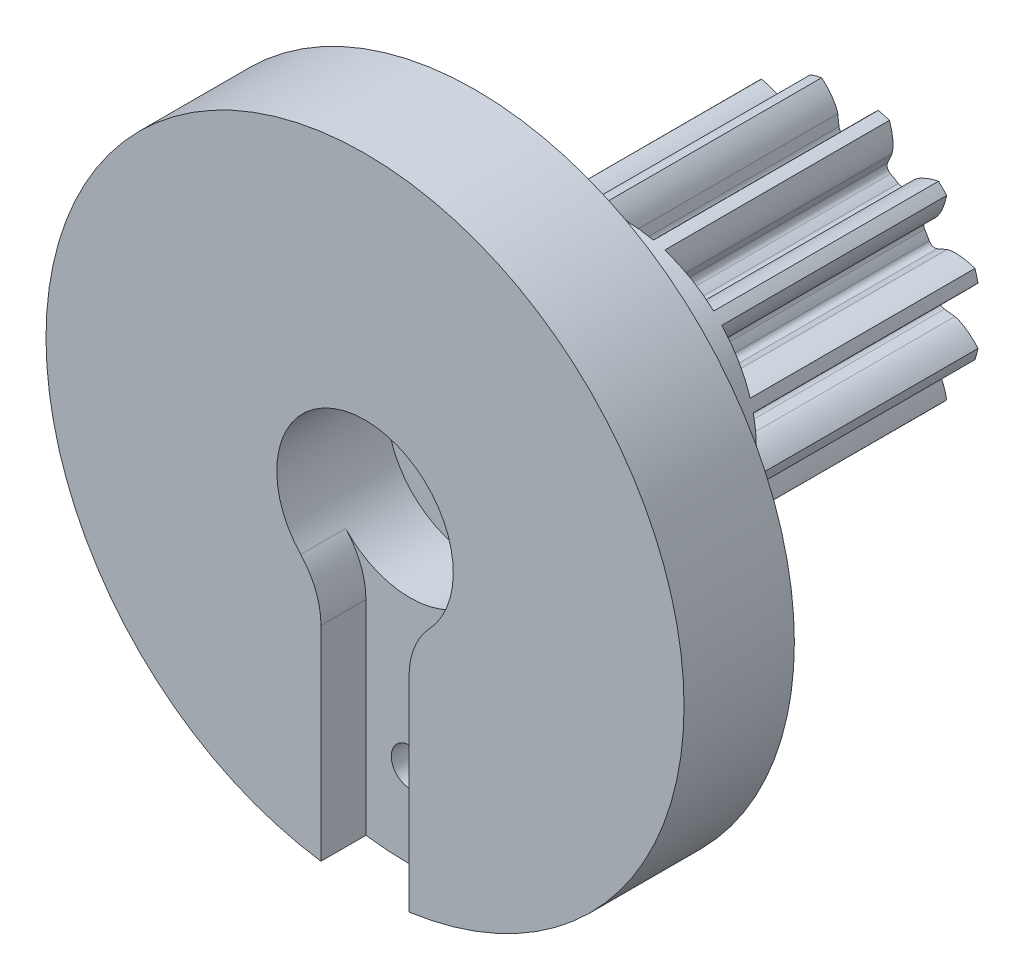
from build123d import *
from build123d.topology import SkipClean

# Parameters (mm, degrees)
BOSS_EXTRUDE1_DEPTH      = 6.35
BOSS_EXTRUDE1_DEPTH_BACK = 6.35
SKETCH3_R                = 7.408333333
SKETCH5_W                = 6.35
SKETCH5_H                = 2.582333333
SKETCH5_W_2              = 12.7
SKETCH5_H_2              = 2.38125
CUT_EXTRUDE1_DEPTH       = 13.251094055
FILLET1_R                = 0.355076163
CIRPATTERN1_COUNT        = 12
FILLET1_OF_CIRPATTERN1_R = 0.355076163
SKETCH6_R                = 9.160380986
CUT_EXTRUDE2_DEPTH       = 6.35
SCALE1_SCALE             = 1.5
SKETCH7_R                = 2.749999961
BOSS_EXTRUDE4_DEPTH      = 3
SKETCH10_R               = 27.0383
SKETCH10_R_2             = 7.4803
SKETCH10_R_3             = 1.5875
BOSS_EXTRUDE5_DEPTH      = 2.54
BOSS_EXTRUDE6_DEPTH      = 3.81
SKETCH14_R               = 3.571875
BOSS_EXTRUDE7_DEPTH      = 9.525
SKETCH18_R               = 5.365798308
SKETCH18_R_2             = 3.2004
BOSS_EXTRUDE8_DEPTH      = 19.05
SKETCH19_R               = 3.2004
BOSS_EXTRUDE9_DEPTH      = 12.7
SKETCH20_W               = 11.1125
SKETCH20_H               = 12.7


with BuildPart() as part:
    # Sketch3 → Boss-Extrude1 (new, two sides: drawn at the far end of the back side and taken through both)
    with BuildSketch(Plane.XY.offset(-BOSS_EXTRUDE1_DEPTH_BACK)):
        Circle(SKETCH3_R)
    extrude(amount=BOSS_EXTRUDE1_DEPTH + BOSS_EXTRUDE1_DEPTH_BACK)

    # Sketch5 → Cut-Revolve1 (revolve, cut)
    with BuildSketch(Plane(origin=(0, 0, 0), x_dir=(0, 0, -1), z_dir=(1, 0, 0)), mode=Mode.PRIVATE) as cut_revolve1_sk:
        with Locations((-3.175, 6.117166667)):
            Rectangle(SKETCH5_W, SKETCH5_H)
        with Locations((0, 1.190625)):
            Rectangle(SKETCH5_W_2, SKETCH5_H_2)
    revolve(cut_revolve1_sk.sketch.rotate(Axis((0, 0, 6.35), (0, 0, -1)), 90), axis=Axis((0, 0, 6.35), (0, 0, -1)), mode=Mode.SUBTRACT)

    # Sketch4 → Cut-Extrude1 (cut, symmetric)
    with BuildSketch(Plane.XY):
        with BuildLine():
            Line((4.993301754, 0.581811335), (5.926950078, 0.690598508))
            add(Edge.make_bspline(
                [(5.926950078, 0.690598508), (5.929318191, 0.690911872), (5.935944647, 0.691904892), (5.948407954, 0.694232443), (5.96863478, 0.69866684), (5.994230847, 0.70524939), (6.027084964, 0.714822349), (6.065467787, 0.727462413), (6.107282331, 0.74277265), (6.152345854, 0.760950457), (6.196898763, 0.780422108), (6.240942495, 0.801081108), (6.284441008, 0.822769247), (6.336662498, 0.8503395), (6.398612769, 0.885198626), (6.469984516, 0.92853373), (6.54965538, 0.980716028), (6.629400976, 1.037091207), (6.706647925, 1.095172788), (6.78320647, 1.156800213), (6.856219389, 1.218511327), (6.930432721, 1.285554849), (6.998115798, 1.348944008), (7.07205666, 1.423150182), (7.131183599, 1.483972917), (7.190627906, 1.549410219), (7.219315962, 1.581641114), (7.233873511, 1.598273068)],
                knots=[0, 0, 0, 0, 0, 0.005376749, 0.015083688, 0.02853182, 0.046610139, 0.064854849, 0.092110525, 0.119476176, 0.146842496, 0.174208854, 0.201574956, 0.228941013, 0.256307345, 0.307035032, 0.361767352, 0.416499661, 0.471231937, 0.525964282, 0.580696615, 0.635428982, 0.690161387, 0.744893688, 0.799626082, 0.854358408, 0.909090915, 0.909090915, 0.909090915, 0.909090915, 0.909090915], degree=4))
            ThreePointArc((7.233873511, 1.598273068), (7.408333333, 0), (7.233873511, -1.598273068))
            add(Edge.make_bspline(
                [(5.926950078, -0.690598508), (5.929318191, -0.690911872), (5.935944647, -0.691904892), (5.948407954, -0.694232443), (5.96863478, -0.69866684), (5.994230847, -0.70524939), (6.027084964, -0.714822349), (6.065467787, -0.727462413), (6.107282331, -0.74277265), (6.152345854, -0.760950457), (6.196898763, -0.780422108), (6.240942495, -0.801081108), (6.284441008, -0.822769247), (6.336662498, -0.8503395), (6.398612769, -0.885198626), (6.469984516, -0.92853373), (6.54965538, -0.980716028), (6.629400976, -1.037091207), (6.706647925, -1.095172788), (6.78320647, -1.156800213), (6.856219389, -1.218511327), (6.930432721, -1.285554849), (6.998115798, -1.348944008), (7.07205666, -1.423150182), (7.131183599, -1.483972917), (7.190627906, -1.549410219), (7.219315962, -1.581641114), (7.233873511, -1.598273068)],
                knots=[0, 0, 0, 0, 0, 0.005376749, 0.015083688, 0.02853182, 0.046610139, 0.064854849, 0.092110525, 0.119476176, 0.146842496, 0.174208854, 0.201574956, 0.228941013, 0.256307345, 0.307035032, 0.361767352, 0.416499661, 0.471231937, 0.525964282, 0.580696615, 0.635428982, 0.690161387, 0.744893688, 0.799626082, 0.854358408, 0.909090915, 0.909090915, 0.909090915, 0.909090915, 0.909090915], degree=4))
            Line((5.926950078, -0.690598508), (4.993301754, -0.581811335))
            ThreePointArc((4.993301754, -0.581811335), (5.027083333, 0), (4.993301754, 0.581811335))
        make_face()
    cut_extrude1 = extrude(amount=CUT_EXTRUDE1_DEPTH, both=True, mode=Mode.SUBTRACT)

    # Fillet1
    fillet1_edges = [part.edges().sort_by_distance(p)[0] for p in [
        (4.993301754, -0.581811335, -3.175),
        (4.993301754, 0.581811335, -3.175),
    ]]
    fillet(fillet1_edges, radius=FILLET1_R)

    # CirPattern1: Cut-Extrude1 ×12 about axis
    cirpattern1_axis = Axis((0, 0, 6.35), (0, 0, -1))
    for i in range(1, CIRPATTERN1_COUNT):
        add(cut_extrude1.rotate(cirpattern1_axis, i * 360 / CIRPATTERN1_COUNT), mode=Mode.SUBTRACT)

    # Fillet1 of CirPattern1
    fillet1_of_cirpattern1_edges = [part.edges().sort_by_distance(p)[0] for p in [
        (4.0334205, -3.000514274, -3.175),
        (4.615231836, -1.99278748, -3.175),
        (1.99278748, -4.615231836, -3.175),
        (3.000514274, -4.0334205, -3.175),
        (-0.581811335, -4.993301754, -3.175),
        (0.581811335, -4.993301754, -3.175),
        (-3.000514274, -4.0334205, -3.175),
        (-1.99278748, -4.615231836, -3.175),
        (-4.615231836, -1.99278748, -3.175),
        (-4.0334205, -3.000514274, -3.175),
        (-4.993301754, 0.581811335, -3.175),
        (-4.993301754, -0.581811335, -3.175),
        (-4.0334205, 3.000514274, -3.175),
        (-4.615231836, 1.99278748, -3.175),
        (-1.99278748, 4.615231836, -3.175),
        (-3.000514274, 4.0334205, -3.175),
        (0.581811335, 4.993301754, -3.175),
        (-0.581811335, 4.993301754, -3.175),
        (3.000514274, 4.0334205, -3.175),
        (1.99278748, 4.615231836, -3.175),
        (4.615231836, 1.99278748, -3.175),
        (4.0334205, 3.000514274, -3.175),
    ]]
    fillet(fillet1_of_cirpattern1_edges, radius=FILLET1_OF_CIRPATTERN1_R)

    # Sketch6 → Cut-Extrude2 (cut)
    with BuildSketch(Plane.XY.offset(6.35)):
        Circle(SKETCH6_R)
    extrude(amount=-CUT_EXTRUDE2_DEPTH, mode=Mode.SUBTRACT)


with BuildPart() as part_1:
    # Scale1: scaled about (-1e-08, 0, -3.174999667)
    add(part.part.scale(SCALE1_SCALE).moved(Location((5e-09, 0, 1.587499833))))

    # Sketch7 → Boss-Extrude4 (add)
    with BuildSketch(Plane.XY.offset(1.587498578)):
        with BuildLine():
            ThreePointArc((3.7338, -26.779253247), (0, 27.0383), (-3.7338, -26.779253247))
            ThreePointArc((-3.7338, -26.779253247), (0, -27.0383), (3.7338, -26.779253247))
        make_face()
        with Locations((0, -19.9009)):
            Circle(SKETCH7_R, mode=Mode.SUBTRACT)
        with BuildLine():
            ThreePointArc((3.7338, -6.481791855), (0, 7.4803), (-3.7338, -6.481791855))
            ThreePointArc((-3.7338, -6.481791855), (0, -7.4803), (3.7338, -6.481791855))
        make_face(mode=Mode.SUBTRACT)
    extrude(amount=BOSS_EXTRUDE4_DEPTH)

    # Sketch10 → Boss-Extrude5 (add)
    with BuildSketch(Plane.XY.offset(4.587498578)):
        with Locations(Location((0, 0, 0), (0, 0, 180))):
            Circle(SKETCH10_R)
        Circle(SKETCH10_R_2, mode=Mode.SUBTRACT)
        with Locations((0, -19.9009)):
            Circle(SKETCH10_R_3, mode=Mode.SUBTRACT)
    extrude(amount=BOSS_EXTRUDE5_DEPTH)

    # Sketch12 → Boss-Extrude6 (add)
    with SkipClean():  # the faces are left unmerged after this step: merging them gives an invalid solid
        with BuildSketch(Plane.XY.offset(7.127498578)):
            with BuildLine():
                Line((3.7338, -9.465419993), (3.7338, -26.779253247))
                ThreePointArc((3.7338, -26.779253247), (26.628963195, 4.687001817), (-5.634233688, 26.444755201))
                ThreePointArc((-5.634233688, 26.444755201), (-27.021080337, -0.964823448), (-3.7338, -26.779253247))
                Line((-3.7338, -26.779253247), (-3.7338, -9.465419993))
                ThreePointArc((-3.7338, -9.465419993), (-4.179479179, -7.128435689), (-5.453956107, -5.119497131))
                ThreePointArc((-5.453956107, -5.119497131), (0, 7.4803), (5.453956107, -5.119497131))
                ThreePointArc((5.453956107, -5.119497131), (4.179479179, -7.128435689), (3.7338, -9.465419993))
            make_face()
        extrude(amount=BOSS_EXTRUDE6_DEPTH)


with BuildPart() as boss_extrude7_tool:
    # Sketch14 → Boss-Extrude7 (new body)
    with SkipClean():  # the faces are left unmerged after this step: merging them gives an invalid solid
        with BuildSketch(Plane(origin=(0, 0, -7.937501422), x_dir=(-1, 0, 0), z_dir=(0, 0, -1))):
            with BuildLine():
                Line((-5.342326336, -7.181385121), (-4.808174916, -6.46335578))
                ThreePointArc((-4.808174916, -6.46335578), (-4.475570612, -6.2571353), (-4.091822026, -6.333878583))
                ThreePointArc((-4.091822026, -6.333878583), (-3.7703125, -6.53037281), (-3.439388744, -6.710561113))
                ThreePointArc((-3.439388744, -6.710561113), (-3.181052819, -7.004525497), (-3.193342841, -7.395679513))
                Line((-3.193342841, -7.395679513), (-3.548098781, -8.217282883))
                add(Edge.make_bspline(
                    [(-3.548098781, -8.217282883), (-3.549467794, -8.220594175), (-3.553147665, -8.229946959), (-3.559471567, -8.247882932), (-3.568881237, -8.277484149), (-3.579527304, -8.315671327), (-3.591732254, -8.365529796), (-3.604099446, -8.424870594), (-3.615571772, -8.490671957), (-3.62575575, -8.562844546), (-3.633876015, -8.635324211), (-3.640071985, -8.708032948), (-3.644522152, -8.780805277), (-3.64787346, -8.869320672), (-3.649052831, -8.97594078), (-3.64628769, -9.101156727), (-3.638254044, -9.243788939), (-3.624829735, -9.38966289), (-3.60731476, -9.533570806), (-3.584677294, -9.679243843), (-3.559271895, -9.820373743), (-3.527839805, -9.96706233), (-3.496257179, -10.102527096), (-3.455316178, -10.254233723), (-3.420650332, -10.376658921), (-3.380228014, -10.502957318), (-3.359874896, -10.564397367), (-3.349187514, -10.595782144)],
                    knots=[0, 0, 0, 0, 0, 0.005376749, 0.015083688, 0.02853182, 0.046610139, 0.064854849, 0.092110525, 0.119476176, 0.146842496, 0.174208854, 0.201574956, 0.228941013, 0.256307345, 0.307035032, 0.361767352, 0.416499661, 0.471231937, 0.525964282, 0.580696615, 0.635428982, 0.690161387, 0.744893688, 0.799626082, 0.854358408, 0.909090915, 0.909090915, 0.909090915, 0.909090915, 0.909090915], degree=4))
                ThreePointArc((-3.349187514, -10.595782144), (-2.876126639, -10.733850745), (-2.397409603, -10.850810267))
                add(Edge.make_bspline(
                    [(-2.397409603, -10.850810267), (-2.37246167, -10.828973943), (-2.324115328, -10.785941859), (-2.225959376, -10.696775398), (-2.134725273, -10.608084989), (-2.023416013, -10.497173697), (-1.928332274, -10.395649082), (-1.827766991, -10.284329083), (-1.73520032, -10.174809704), (-1.642759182, -10.059971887), (-1.555636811, -9.944101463), (-1.471074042, -9.824483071), (-1.392800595, -9.704976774), (-1.327797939, -9.597919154), (-1.27550925, -9.504993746), (-1.23415387, -9.426661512), (-1.201621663, -9.361413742), (-1.170633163, -9.295348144), (-1.141425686, -9.22851878), (-1.114158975, -9.160923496), (-1.091193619, -9.098201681), (-1.072233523, -9.040627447), (-1.057874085, -8.991346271), (-1.04800026, -8.952952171), (-1.041348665, -8.92261193), (-1.037857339, -8.903916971), (-1.036367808, -8.893977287), (-1.035897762, -8.890425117)],
                    knots=[0, 0, 0, 0, 0, 0.054732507, 0.109464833, 0.164197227, 0.218929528, 0.273661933, 0.328394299, 0.383126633, 0.437858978, 0.492591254, 0.547323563, 0.602055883, 0.65278357, 0.680149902, 0.707515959, 0.734882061, 0.762248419, 0.789614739, 0.81698039, 0.844236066, 0.862480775, 0.880559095, 0.894007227, 0.903714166, 0.909090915, 0.909090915, 0.909090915, 0.909090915, 0.909090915], degree=4))
                Line((-1.035897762, -8.890425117), (-0.932323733, -8.001517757))
                ThreePointArc((-0.932323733, -8.001517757), (-0.747390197, -7.656623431), (-0.376682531, -7.53121077))
                ThreePointArc((-0.376682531, -7.53121077), (0, -7.540625), (0.376682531, -7.53121077))
                ThreePointArc((0.376682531, -7.53121077), (0.747390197, -7.656623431), (0.932323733, -8.001517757))
                Line((0.932323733, -8.001517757), (1.035897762, -8.890425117))
                add(Edge.make_bspline(
                    [(1.035897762, -8.890425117), (1.036367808, -8.893977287), (1.037857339, -8.903916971), (1.041348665, -8.92261193), (1.04800026, -8.952952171), (1.057874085, -8.991346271), (1.072233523, -9.040627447), (1.091193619, -9.098201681), (1.114158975, -9.160923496), (1.141425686, -9.22851878), (1.170633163, -9.295348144), (1.201621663, -9.361413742), (1.23415387, -9.426661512), (1.27550925, -9.504993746), (1.327797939, -9.597919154), (1.392800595, -9.704976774), (1.471074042, -9.824483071), (1.555636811, -9.944101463), (1.642759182, -10.059971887), (1.73520032, -10.174809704), (1.827766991, -10.284329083), (1.928332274, -10.395649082), (2.023416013, -10.497173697), (2.134725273, -10.608084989), (2.225959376, -10.696775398), (2.324115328, -10.785941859), (2.37246167, -10.828973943), (2.397409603, -10.850810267)],
                    knots=[0, 0, 0, 0, 0, 0.005376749, 0.015083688, 0.02853182, 0.046610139, 0.064854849, 0.092110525, 0.119476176, 0.146842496, 0.174208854, 0.201574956, 0.228941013, 0.256307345, 0.307035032, 0.361767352, 0.416499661, 0.471231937, 0.525964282, 0.580696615, 0.635428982, 0.690161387, 0.744893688, 0.799626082, 0.854358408, 0.909090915, 0.909090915, 0.909090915, 0.909090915, 0.909090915], degree=4))
                ThreePointArc((2.397409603, -10.850810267), (2.876126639, -10.733850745), (3.349187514, -10.595782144))
                add(Edge.make_bspline(
                    [(3.349187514, -10.595782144), (3.359874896, -10.564397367), (3.380228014, -10.502957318), (3.420650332, -10.376658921), (3.455316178, -10.254233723), (3.496257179, -10.102527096), (3.527839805, -9.96706233), (3.559271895, -9.820373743), (3.584677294, -9.679243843), (3.60731476, -9.533570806), (3.624829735, -9.38966289), (3.638254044, -9.243788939), (3.64628769, -9.101156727), (3.649052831, -8.97594078), (3.64787346, -8.869320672), (3.644522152, -8.780805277), (3.640071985, -8.708032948), (3.633876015, -8.635324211), (3.62575575, -8.562844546), (3.615571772, -8.490671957), (3.604099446, -8.424870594), (3.591732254, -8.365529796), (3.579527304, -8.315671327), (3.568881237, -8.277484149), (3.559471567, -8.247882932), (3.553147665, -8.229946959), (3.549467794, -8.220594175), (3.548098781, -8.217282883)],
                    knots=[0, 0, 0, 0, 0, 0.054732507, 0.109464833, 0.164197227, 0.218929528, 0.273661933, 0.328394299, 0.383126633, 0.437858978, 0.492591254, 0.547323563, 0.602055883, 0.65278357, 0.680149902, 0.707515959, 0.734882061, 0.762248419, 0.789614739, 0.81698039, 0.844236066, 0.862480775, 0.880559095, 0.894007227, 0.903714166, 0.909090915, 0.909090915, 0.909090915, 0.909090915, 0.909090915], degree=4))
                Line((3.548098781, -8.217282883), (3.193342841, -7.395679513))
                ThreePointArc((3.193342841, -7.395679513), (3.181052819, -7.004525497), (3.439388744, -6.710561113))
                ThreePointArc((3.439388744, -6.710561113), (3.7703125, -6.53037281), (4.091822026, -6.333878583))
                ThreePointArc((4.091822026, -6.333878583), (4.475570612, -6.2571353), (4.808174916, -6.46335578))
                Line((4.808174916, -6.46335578), (5.342326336, -7.181385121))
                add(Edge.make_bspline(
                    [(5.342326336, -7.181385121), (5.344509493, -7.184226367), (5.350769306, -7.192089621), (5.363140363, -7.206534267), (5.384070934, -7.229483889), (5.411818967, -7.257797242), (5.448895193, -7.293296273), (5.494102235, -7.333676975), (5.545351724, -7.376512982), (5.602763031, -7.42141886), (5.661472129, -7.464691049), (5.721341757, -7.506411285), (5.782139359, -7.546651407), (5.857120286, -7.593811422), (5.948866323, -7.648142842), (6.058689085, -7.708356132), (6.186229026, -7.772714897), (6.319271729, -7.83402608), (6.452657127, -7.890811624), (6.59013241, -7.944043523), (6.725057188, -7.992606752), (6.867809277, -8.038730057), (7.000916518, -8.079111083), (7.152768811, -8.11950845), (7.276125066, -8.150699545), (7.405713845, -8.17884199), (7.469099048, -8.191935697), (7.501622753, -8.198372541)],
                    knots=[0, 0, 0, 0, 0, 0.005376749, 0.015083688, 0.02853182, 0.046610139, 0.064854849, 0.092110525, 0.119476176, 0.146842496, 0.174208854, 0.201574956, 0.228941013, 0.256307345, 0.307035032, 0.361767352, 0.416499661, 0.471231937, 0.525964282, 0.580696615, 0.635428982, 0.690161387, 0.744893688, 0.799626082, 0.854358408, 0.909090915, 0.909090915, 0.909090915, 0.909090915, 0.909090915], degree=4))
                ThreePointArc((7.501622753, -8.198372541), (7.857724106, -7.857724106), (8.198372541, -7.501622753))
                add(Edge.make_bspline(
                    [(8.198372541, -7.501622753), (8.191935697, -7.469099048), (8.17884199, -7.405713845), (8.150699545, -7.276125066), (8.11950845, -7.152768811), (8.079111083, -7.000916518), (8.038730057, -6.867809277), (7.992606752, -6.725057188), (7.944043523, -6.59013241), (7.890811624, -6.452657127), (7.83402608, -6.319271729), (7.772714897, -6.186229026), (7.708356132, -6.058689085), (7.648142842, -5.948866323), (7.593811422, -5.857120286), (7.546651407, -5.782139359), (7.506411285, -5.721341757), (7.464691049, -5.661472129), (7.42141886, -5.602763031), (7.376512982, -5.545351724), (7.333676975, -5.494102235), (7.293296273, -5.448895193), (7.257797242, -5.411818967), (7.229483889, -5.384070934), (7.206534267, -5.363140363), (7.192089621, -5.350769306), (7.184226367, -5.344509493), (7.181385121, -5.342326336)],
                    knots=[0, 0, 0, 0, 0, 0.054732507, 0.109464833, 0.164197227, 0.218929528, 0.273661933, 0.328394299, 0.383126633, 0.437858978, 0.492591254, 0.547323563, 0.602055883, 0.65278357, 0.680149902, 0.707515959, 0.734882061, 0.762248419, 0.789614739, 0.81698039, 0.844236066, 0.862480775, 0.880559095, 0.894007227, 0.903714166, 0.909090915, 0.909090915, 0.909090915, 0.909090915, 0.909090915], degree=4))
                Line((7.181385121, -5.342326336), (6.46335578, -4.808174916))
                ThreePointArc((6.46335578, -4.808174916), (6.2571353, -4.475570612), (6.333878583, -4.091822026))
                ThreePointArc((6.333878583, -4.091822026), (6.53037281, -3.7703125), (6.710561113, -3.439388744))
                ThreePointArc((6.710561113, -3.439388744), (7.004525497, -3.181052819), (7.395679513, -3.193342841))
                Line((7.395679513, -3.193342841), (8.217282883, -3.548098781))
                add(Edge.make_bspline(
                    [(8.217282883, -3.548098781), (8.220594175, -3.549467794), (8.229946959, -3.553147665), (8.247882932, -3.559471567), (8.277484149, -3.568881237), (8.315671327, -3.579527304), (8.365529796, -3.591732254), (8.424870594, -3.604099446), (8.490671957, -3.615571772), (8.562844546, -3.62575575), (8.635324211, -3.633876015), (8.708032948, -3.640071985), (8.780805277, -3.644522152), (8.869320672, -3.64787346), (8.97594078, -3.649052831), (9.101156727, -3.64628769), (9.243788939, -3.638254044), (9.38966289, -3.624829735), (9.533570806, -3.60731476), (9.679243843, -3.584677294), (9.820373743, -3.559271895), (9.96706233, -3.527839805), (10.102527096, -3.496257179), (10.254233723, -3.455316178), (10.376658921, -3.420650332), (10.502957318, -3.380228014), (10.564397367, -3.359874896), (10.595782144, -3.349187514)],
                    knots=[0, 0, 0, 0, 0, 0.005376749, 0.015083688, 0.02853182, 0.046610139, 0.064854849, 0.092110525, 0.119476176, 0.146842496, 0.174208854, 0.201574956, 0.228941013, 0.256307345, 0.307035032, 0.361767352, 0.416499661, 0.471231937, 0.525964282, 0.580696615, 0.635428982, 0.690161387, 0.744893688, 0.799626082, 0.854358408, 0.909090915, 0.909090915, 0.909090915, 0.909090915, 0.909090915], degree=4))
                ThreePointArc((10.595782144, -3.349187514), (10.733850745, -2.876126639), (10.850810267, -2.397409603))
                add(Edge.make_bspline(
                    [(10.850810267, -2.397409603), (10.828973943, -2.37246167), (10.785941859, -2.324115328), (10.696775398, -2.225959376), (10.608084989, -2.134725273), (10.497173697, -2.023416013), (10.395649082, -1.928332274), (10.284329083, -1.827766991), (10.174809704, -1.73520032), (10.059971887, -1.642759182), (9.944101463, -1.555636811), (9.824483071, -1.471074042), (9.704976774, -1.392800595), (9.597919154, -1.327797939), (9.504993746, -1.27550925), (9.426661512, -1.23415387), (9.361413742, -1.201621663), (9.295348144, -1.170633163), (9.22851878, -1.141425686), (9.160923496, -1.114158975), (9.098201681, -1.091193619), (9.040627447, -1.072233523), (8.991346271, -1.057874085), (8.952952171, -1.04800026), (8.92261193, -1.041348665), (8.903916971, -1.037857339), (8.893977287, -1.036367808), (8.890425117, -1.035897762)],
                    knots=[0, 0, 0, 0, 0, 0.054732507, 0.109464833, 0.164197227, 0.218929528, 0.273661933, 0.328394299, 0.383126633, 0.437858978, 0.492591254, 0.547323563, 0.602055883, 0.65278357, 0.680149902, 0.707515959, 0.734882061, 0.762248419, 0.789614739, 0.81698039, 0.844236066, 0.862480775, 0.880559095, 0.894007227, 0.903714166, 0.909090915, 0.909090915, 0.909090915, 0.909090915, 0.909090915], degree=4))
                Line((8.890425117, -1.035897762), (8.001517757, -0.932323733))
                ThreePointArc((8.001517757, -0.932323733), (7.656623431, -0.747390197), (7.53121077, -0.376682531))
                ThreePointArc((7.53121077, -0.376682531), (7.540625, 0), (7.53121077, 0.376682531))
                ThreePointArc((7.53121077, 0.376682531), (7.656623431, 0.747390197), (8.001517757, 0.932323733))
                Line((8.001517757, 0.932323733), (8.890425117, 1.035897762))
                add(Edge.make_bspline(
                    [(8.890425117, 1.035897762), (8.893977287, 1.036367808), (8.903916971, 1.037857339), (8.92261193, 1.041348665), (8.952952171, 1.04800026), (8.991346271, 1.057874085), (9.040627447, 1.072233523), (9.098201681, 1.091193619), (9.160923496, 1.114158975), (9.22851878, 1.141425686), (9.295348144, 1.170633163), (9.361413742, 1.201621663), (9.426661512, 1.23415387), (9.504993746, 1.27550925), (9.597919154, 1.327797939), (9.704976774, 1.392800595), (9.824483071, 1.471074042), (9.944101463, 1.555636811), (10.059971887, 1.642759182), (10.174809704, 1.73520032), (10.284329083, 1.827766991), (10.395649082, 1.928332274), (10.497173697, 2.023416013), (10.608084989, 2.134725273), (10.696775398, 2.225959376), (10.785941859, 2.324115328), (10.828973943, 2.37246167), (10.850810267, 2.397409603)],
                    knots=[0, 0, 0, 0, 0, 0.005376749, 0.015083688, 0.02853182, 0.046610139, 0.064854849, 0.092110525, 0.119476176, 0.146842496, 0.174208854, 0.201574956, 0.228941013, 0.256307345, 0.307035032, 0.361767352, 0.416499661, 0.471231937, 0.525964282, 0.580696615, 0.635428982, 0.690161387, 0.744893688, 0.799626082, 0.854358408, 0.909090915, 0.909090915, 0.909090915, 0.909090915, 0.909090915], degree=4))
                ThreePointArc((10.850810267, 2.397409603), (10.733850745, 2.876126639), (10.595782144, 3.349187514))
                add(Edge.make_bspline(
                    [(10.595782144, 3.349187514), (10.564397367, 3.359874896), (10.502957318, 3.380228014), (10.376658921, 3.420650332), (10.254233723, 3.455316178), (10.102527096, 3.496257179), (9.96706233, 3.527839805), (9.820373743, 3.559271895), (9.679243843, 3.584677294), (9.533570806, 3.60731476), (9.38966289, 3.624829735), (9.243788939, 3.638254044), (9.101156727, 3.64628769), (8.97594078, 3.649052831), (8.869320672, 3.64787346), (8.780805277, 3.644522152), (8.708032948, 3.640071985), (8.635324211, 3.633876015), (8.562844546, 3.62575575), (8.490671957, 3.615571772), (8.424870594, 3.604099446), (8.365529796, 3.591732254), (8.315671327, 3.579527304), (8.277484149, 3.568881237), (8.247882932, 3.559471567), (8.229946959, 3.553147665), (8.220594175, 3.549467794), (8.217282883, 3.548098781)],
                    knots=[0, 0, 0, 0, 0, 0.054732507, 0.109464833, 0.164197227, 0.218929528, 0.273661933, 0.328394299, 0.383126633, 0.437858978, 0.492591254, 0.547323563, 0.602055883, 0.65278357, 0.680149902, 0.707515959, 0.734882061, 0.762248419, 0.789614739, 0.81698039, 0.844236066, 0.862480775, 0.880559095, 0.894007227, 0.903714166, 0.909090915, 0.909090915, 0.909090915, 0.909090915, 0.909090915], degree=4))
                Line((8.217282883, 3.548098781), (7.395679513, 3.193342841))
                ThreePointArc((7.395679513, 3.193342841), (7.004525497, 3.181052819), (6.710561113, 3.439388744))
                ThreePointArc((6.710561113, 3.439388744), (6.53037281, 3.7703125), (6.333878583, 4.091822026))
                ThreePointArc((6.333878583, 4.091822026), (6.2571353, 4.475570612), (6.46335578, 4.808174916))
                Line((6.46335578, 4.808174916), (7.181385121, 5.342326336))
                add(Edge.make_bspline(
                    [(7.181385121, 5.342326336), (7.184226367, 5.344509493), (7.192089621, 5.350769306), (7.206534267, 5.363140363), (7.229483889, 5.384070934), (7.257797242, 5.411818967), (7.293296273, 5.448895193), (7.333676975, 5.494102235), (7.376512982, 5.545351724), (7.42141886, 5.602763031), (7.464691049, 5.661472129), (7.506411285, 5.721341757), (7.546651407, 5.782139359), (7.593811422, 5.857120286), (7.648142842, 5.948866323), (7.708356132, 6.058689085), (7.772714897, 6.186229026), (7.83402608, 6.319271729), (7.890811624, 6.452657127), (7.944043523, 6.59013241), (7.992606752, 6.725057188), (8.038730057, 6.867809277), (8.079111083, 7.000916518), (8.11950845, 7.152768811), (8.150699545, 7.276125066), (8.17884199, 7.405713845), (8.191935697, 7.469099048), (8.198372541, 7.501622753)],
                    knots=[0, 0, 0, 0, 0, 0.005376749, 0.015083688, 0.02853182, 0.046610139, 0.064854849, 0.092110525, 0.119476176, 0.146842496, 0.174208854, 0.201574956, 0.228941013, 0.256307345, 0.307035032, 0.361767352, 0.416499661, 0.471231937, 0.525964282, 0.580696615, 0.635428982, 0.690161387, 0.744893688, 0.799626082, 0.854358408, 0.909090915, 0.909090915, 0.909090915, 0.909090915, 0.909090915], degree=4))
                ThreePointArc((8.198372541, 7.501622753), (7.857724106, 7.857724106), (7.501622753, 8.198372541))
                add(Edge.make_bspline(
                    [(7.501622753, 8.198372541), (7.469099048, 8.191935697), (7.405713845, 8.17884199), (7.276125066, 8.150699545), (7.152768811, 8.11950845), (7.000916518, 8.079111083), (6.867809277, 8.038730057), (6.725057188, 7.992606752), (6.59013241, 7.944043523), (6.452657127, 7.890811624), (6.319271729, 7.83402608), (6.186229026, 7.772714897), (6.058689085, 7.708356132), (5.948866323, 7.648142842), (5.857120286, 7.593811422), (5.782139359, 7.546651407), (5.721341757, 7.506411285), (5.661472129, 7.464691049), (5.602763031, 7.42141886), (5.545351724, 7.376512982), (5.494102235, 7.333676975), (5.448895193, 7.293296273), (5.411818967, 7.257797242), (5.384070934, 7.229483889), (5.363140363, 7.206534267), (5.350769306, 7.192089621), (5.344509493, 7.184226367), (5.342326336, 7.181385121)],
                    knots=[0, 0, 0, 0, 0, 0.054732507, 0.109464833, 0.164197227, 0.218929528, 0.273661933, 0.328394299, 0.383126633, 0.437858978, 0.492591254, 0.547323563, 0.602055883, 0.65278357, 0.680149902, 0.707515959, 0.734882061, 0.762248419, 0.789614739, 0.81698039, 0.844236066, 0.862480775, 0.880559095, 0.894007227, 0.903714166, 0.909090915, 0.909090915, 0.909090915, 0.909090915, 0.909090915], degree=4))
                Line((5.342326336, 7.181385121), (4.808174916, 6.46335578))
                ThreePointArc((4.808174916, 6.46335578), (4.475570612, 6.2571353), (4.091822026, 6.333878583))
                ThreePointArc((4.091822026, 6.333878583), (3.7703125, 6.53037281), (3.439388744, 6.710561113))
                ThreePointArc((3.439388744, 6.710561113), (3.181052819, 7.004525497), (3.193342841, 7.395679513))
                Line((3.193342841, 7.395679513), (3.548098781, 8.217282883))
                add(Edge.make_bspline(
                    [(3.548098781, 8.217282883), (3.549467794, 8.220594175), (3.553147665, 8.229946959), (3.559471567, 8.247882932), (3.568881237, 8.277484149), (3.579527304, 8.315671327), (3.591732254, 8.365529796), (3.604099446, 8.424870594), (3.615571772, 8.490671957), (3.62575575, 8.562844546), (3.633876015, 8.635324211), (3.640071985, 8.708032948), (3.644522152, 8.780805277), (3.64787346, 8.869320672), (3.649052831, 8.97594078), (3.64628769, 9.101156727), (3.638254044, 9.243788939), (3.624829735, 9.38966289), (3.60731476, 9.533570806), (3.584677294, 9.679243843), (3.559271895, 9.820373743), (3.527839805, 9.96706233), (3.496257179, 10.102527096), (3.455316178, 10.254233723), (3.420650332, 10.376658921), (3.380228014, 10.502957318), (3.359874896, 10.564397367), (3.349187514, 10.595782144)],
                    knots=[0, 0, 0, 0, 0, 0.005376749, 0.015083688, 0.02853182, 0.046610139, 0.064854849, 0.092110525, 0.119476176, 0.146842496, 0.174208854, 0.201574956, 0.228941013, 0.256307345, 0.307035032, 0.361767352, 0.416499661, 0.471231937, 0.525964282, 0.580696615, 0.635428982, 0.690161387, 0.744893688, 0.799626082, 0.854358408, 0.909090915, 0.909090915, 0.909090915, 0.909090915, 0.909090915], degree=4))
                ThreePointArc((3.349187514, 10.595782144), (2.876126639, 10.733850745), (2.397409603, 10.850810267))
                add(Edge.make_bspline(
                    [(2.397409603, 10.850810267), (2.37246167, 10.828973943), (2.324115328, 10.785941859), (2.225959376, 10.696775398), (2.134725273, 10.608084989), (2.023416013, 10.497173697), (1.928332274, 10.395649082), (1.827766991, 10.284329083), (1.73520032, 10.174809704), (1.642759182, 10.059971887), (1.555636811, 9.944101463), (1.471074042, 9.824483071), (1.392800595, 9.704976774), (1.327797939, 9.597919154), (1.27550925, 9.504993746), (1.23415387, 9.426661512), (1.201621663, 9.361413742), (1.170633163, 9.295348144), (1.141425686, 9.22851878), (1.114158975, 9.160923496), (1.091193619, 9.098201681), (1.072233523, 9.040627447), (1.057874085, 8.991346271), (1.04800026, 8.952952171), (1.041348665, 8.92261193), (1.037857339, 8.903916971), (1.036367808, 8.893977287), (1.035897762, 8.890425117)],
                    knots=[0, 0, 0, 0, 0, 0.054732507, 0.109464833, 0.164197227, 0.218929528, 0.273661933, 0.328394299, 0.383126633, 0.437858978, 0.492591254, 0.547323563, 0.602055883, 0.65278357, 0.680149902, 0.707515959, 0.734882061, 0.762248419, 0.789614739, 0.81698039, 0.844236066, 0.862480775, 0.880559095, 0.894007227, 0.903714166, 0.909090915, 0.909090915, 0.909090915, 0.909090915, 0.909090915], degree=4))
                Line((1.035897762, 8.890425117), (0.932323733, 8.001517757))
                ThreePointArc((0.932323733, 8.001517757), (0.747390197, 7.656623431), (0.376682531, 7.53121077))
                ThreePointArc((0.376682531, 7.53121077), (0, 7.540625), (-0.376682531, 7.53121077))
                ThreePointArc((-0.376682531, 7.53121077), (-0.747390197, 7.656623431), (-0.932323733, 8.001517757))
                Line((-0.932323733, 8.001517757), (-1.035897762, 8.890425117))
                add(Edge.make_bspline(
                    [(-1.035897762, 8.890425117), (-1.036367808, 8.893977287), (-1.037857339, 8.903916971), (-1.041348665, 8.92261193), (-1.04800026, 8.952952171), (-1.057874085, 8.991346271), (-1.072233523, 9.040627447), (-1.091193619, 9.098201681), (-1.114158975, 9.160923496), (-1.141425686, 9.22851878), (-1.170633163, 9.295348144), (-1.201621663, 9.361413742), (-1.23415387, 9.426661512), (-1.27550925, 9.504993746), (-1.327797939, 9.597919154), (-1.392800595, 9.704976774), (-1.471074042, 9.824483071), (-1.555636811, 9.944101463), (-1.642759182, 10.059971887), (-1.73520032, 10.174809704), (-1.827766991, 10.284329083), (-1.928332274, 10.395649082), (-2.023416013, 10.497173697), (-2.134725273, 10.608084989), (-2.225959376, 10.696775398), (-2.324115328, 10.785941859), (-2.37246167, 10.828973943), (-2.397409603, 10.850810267)],
                    knots=[0, 0, 0, 0, 0, 0.005376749, 0.015083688, 0.02853182, 0.046610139, 0.064854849, 0.092110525, 0.119476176, 0.146842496, 0.174208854, 0.201574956, 0.228941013, 0.256307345, 0.307035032, 0.361767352, 0.416499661, 0.471231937, 0.525964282, 0.580696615, 0.635428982, 0.690161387, 0.744893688, 0.799626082, 0.854358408, 0.909090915, 0.909090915, 0.909090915, 0.909090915, 0.909090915], degree=4))
                ThreePointArc((-2.397409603, 10.850810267), (-2.876126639, 10.733850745), (-3.349187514, 10.595782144))
                add(Edge.make_bspline(
                    [(-3.349187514, 10.595782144), (-3.359874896, 10.564397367), (-3.380228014, 10.502957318), (-3.420650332, 10.376658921), (-3.455316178, 10.254233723), (-3.496257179, 10.102527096), (-3.527839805, 9.96706233), (-3.559271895, 9.820373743), (-3.584677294, 9.679243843), (-3.60731476, 9.533570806), (-3.624829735, 9.38966289), (-3.638254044, 9.243788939), (-3.64628769, 9.101156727), (-3.649052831, 8.97594078), (-3.64787346, 8.869320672), (-3.644522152, 8.780805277), (-3.640071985, 8.708032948), (-3.633876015, 8.635324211), (-3.62575575, 8.562844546), (-3.615571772, 8.490671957), (-3.604099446, 8.424870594), (-3.591732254, 8.365529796), (-3.579527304, 8.315671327), (-3.568881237, 8.277484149), (-3.559471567, 8.247882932), (-3.553147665, 8.229946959), (-3.549467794, 8.220594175), (-3.548098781, 8.217282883)],
                    knots=[0, 0, 0, 0, 0, 0.054732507, 0.109464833, 0.164197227, 0.218929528, 0.273661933, 0.328394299, 0.383126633, 0.437858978, 0.492591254, 0.547323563, 0.602055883, 0.65278357, 0.680149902, 0.707515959, 0.734882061, 0.762248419, 0.789614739, 0.81698039, 0.844236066, 0.862480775, 0.880559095, 0.894007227, 0.903714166, 0.909090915, 0.909090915, 0.909090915, 0.909090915, 0.909090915], degree=4))
                Line((-3.548098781, 8.217282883), (-3.193342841, 7.395679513))
                ThreePointArc((-3.193342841, 7.395679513), (-3.181052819, 7.004525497), (-3.439388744, 6.710561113))
                ThreePointArc((-3.439388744, 6.710561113), (-3.7703125, 6.53037281), (-4.091822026, 6.333878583))
                ThreePointArc((-4.091822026, 6.333878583), (-4.475570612, 6.2571353), (-4.808174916, 6.46335578))
                Line((-4.808174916, 6.46335578), (-5.342326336, 7.181385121))
                add(Edge.make_bspline(
                    [(-5.342326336, 7.181385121), (-5.344509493, 7.184226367), (-5.350769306, 7.192089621), (-5.363140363, 7.206534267), (-5.384070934, 7.229483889), (-5.411818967, 7.257797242), (-5.448895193, 7.293296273), (-5.494102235, 7.333676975), (-5.545351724, 7.376512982), (-5.602763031, 7.42141886), (-5.661472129, 7.464691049), (-5.721341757, 7.506411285), (-5.782139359, 7.546651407), (-5.857120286, 7.593811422), (-5.948866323, 7.648142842), (-6.058689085, 7.708356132), (-6.186229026, 7.772714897), (-6.319271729, 7.83402608), (-6.452657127, 7.890811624), (-6.59013241, 7.944043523), (-6.725057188, 7.992606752), (-6.867809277, 8.038730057), (-7.000916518, 8.079111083), (-7.152768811, 8.11950845), (-7.276125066, 8.150699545), (-7.405713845, 8.17884199), (-7.469099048, 8.191935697), (-7.501622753, 8.198372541)],
                    knots=[0, 0, 0, 0, 0, 0.005376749, 0.015083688, 0.02853182, 0.046610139, 0.064854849, 0.092110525, 0.119476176, 0.146842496, 0.174208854, 0.201574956, 0.228941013, 0.256307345, 0.307035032, 0.361767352, 0.416499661, 0.471231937, 0.525964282, 0.580696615, 0.635428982, 0.690161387, 0.744893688, 0.799626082, 0.854358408, 0.909090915, 0.909090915, 0.909090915, 0.909090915, 0.909090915], degree=4))
                ThreePointArc((-7.501622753, 8.198372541), (-7.857724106, 7.857724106), (-8.198372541, 7.501622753))
                add(Edge.make_bspline(
                    [(-8.198372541, 7.501622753), (-8.191935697, 7.469099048), (-8.17884199, 7.405713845), (-8.150699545, 7.276125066), (-8.11950845, 7.152768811), (-8.079111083, 7.000916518), (-8.038730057, 6.867809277), (-7.992606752, 6.725057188), (-7.944043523, 6.59013241), (-7.890811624, 6.452657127), (-7.83402608, 6.319271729), (-7.772714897, 6.186229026), (-7.708356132, 6.058689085), (-7.648142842, 5.948866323), (-7.593811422, 5.857120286), (-7.546651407, 5.782139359), (-7.506411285, 5.721341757), (-7.464691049, 5.661472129), (-7.42141886, 5.602763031), (-7.376512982, 5.545351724), (-7.333676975, 5.494102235), (-7.293296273, 5.448895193), (-7.257797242, 5.411818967), (-7.229483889, 5.384070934), (-7.206534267, 5.363140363), (-7.192089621, 5.350769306), (-7.184226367, 5.344509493), (-7.181385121, 5.342326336)],
                    knots=[0, 0, 0, 0, 0, 0.054732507, 0.109464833, 0.164197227, 0.218929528, 0.273661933, 0.328394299, 0.383126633, 0.437858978, 0.492591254, 0.547323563, 0.602055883, 0.65278357, 0.680149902, 0.707515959, 0.734882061, 0.762248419, 0.789614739, 0.81698039, 0.844236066, 0.862480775, 0.880559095, 0.894007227, 0.903714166, 0.909090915, 0.909090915, 0.909090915, 0.909090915, 0.909090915], degree=4))
                Line((-7.181385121, 5.342326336), (-6.46335578, 4.808174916))
                ThreePointArc((-6.46335578, 4.808174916), (-6.2571353, 4.475570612), (-6.333878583, 4.091822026))
                ThreePointArc((-6.333878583, 4.091822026), (-6.53037281, 3.7703125), (-6.710561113, 3.439388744))
                ThreePointArc((-6.710561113, 3.439388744), (-7.004525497, 3.181052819), (-7.395679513, 3.193342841))
                Line((-7.395679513, 3.193342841), (-8.217282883, 3.548098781))
                add(Edge.make_bspline(
                    [(-8.217282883, 3.548098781), (-8.220594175, 3.549467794), (-8.229946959, 3.553147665), (-8.247882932, 3.559471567), (-8.277484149, 3.568881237), (-8.315671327, 3.579527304), (-8.365529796, 3.591732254), (-8.424870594, 3.604099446), (-8.490671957, 3.615571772), (-8.562844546, 3.62575575), (-8.635324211, 3.633876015), (-8.708032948, 3.640071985), (-8.780805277, 3.644522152), (-8.869320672, 3.64787346), (-8.97594078, 3.649052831), (-9.101156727, 3.64628769), (-9.243788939, 3.638254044), (-9.38966289, 3.624829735), (-9.533570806, 3.60731476), (-9.679243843, 3.584677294), (-9.820373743, 3.559271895), (-9.96706233, 3.527839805), (-10.102527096, 3.496257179), (-10.254233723, 3.455316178), (-10.376658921, 3.420650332), (-10.502957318, 3.380228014), (-10.564397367, 3.359874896), (-10.595782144, 3.349187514)],
                    knots=[0, 0, 0, 0, 0, 0.005376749, 0.015083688, 0.02853182, 0.046610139, 0.064854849, 0.092110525, 0.119476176, 0.146842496, 0.174208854, 0.201574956, 0.228941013, 0.256307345, 0.307035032, 0.361767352, 0.416499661, 0.471231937, 0.525964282, 0.580696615, 0.635428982, 0.690161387, 0.744893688, 0.799626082, 0.854358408, 0.909090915, 0.909090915, 0.909090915, 0.909090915, 0.909090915], degree=4))
                ThreePointArc((-10.595782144, 3.349187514), (-10.733850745, 2.876126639), (-10.850810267, 2.397409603))
                add(Edge.make_bspline(
                    [(-10.850810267, 2.397409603), (-10.828973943, 2.37246167), (-10.785941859, 2.324115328), (-10.696775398, 2.225959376), (-10.608084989, 2.134725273), (-10.497173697, 2.023416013), (-10.395649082, 1.928332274), (-10.284329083, 1.827766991), (-10.174809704, 1.73520032), (-10.059971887, 1.642759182), (-9.944101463, 1.555636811), (-9.824483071, 1.471074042), (-9.704976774, 1.392800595), (-9.597919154, 1.327797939), (-9.504993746, 1.27550925), (-9.426661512, 1.23415387), (-9.361413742, 1.201621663), (-9.295348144, 1.170633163), (-9.22851878, 1.141425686), (-9.160923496, 1.114158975), (-9.098201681, 1.091193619), (-9.040627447, 1.072233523), (-8.991346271, 1.057874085), (-8.952952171, 1.04800026), (-8.92261193, 1.041348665), (-8.903916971, 1.037857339), (-8.893977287, 1.036367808), (-8.890425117, 1.035897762)],
                    knots=[0, 0, 0, 0, 0, 0.054732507, 0.109464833, 0.164197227, 0.218929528, 0.273661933, 0.328394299, 0.383126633, 0.437858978, 0.492591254, 0.547323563, 0.602055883, 0.65278357, 0.680149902, 0.707515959, 0.734882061, 0.762248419, 0.789614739, 0.81698039, 0.844236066, 0.862480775, 0.880559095, 0.894007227, 0.903714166, 0.909090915, 0.909090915, 0.909090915, 0.909090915, 0.909090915], degree=4))
                Line((-8.890425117, 1.035897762), (-8.001517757, 0.932323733))
                ThreePointArc((-8.001517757, 0.932323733), (-7.656623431, 0.747390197), (-7.53121077, 0.376682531))
                ThreePointArc((-7.53121077, 0.376682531), (-7.540625, 0), (-7.53121077, -0.376682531))
                ThreePointArc((-7.53121077, -0.376682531), (-7.656623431, -0.747390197), (-8.001517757, -0.932323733))
                Line((-8.001517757, -0.932323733), (-8.890425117, -1.035897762))
                add(Edge.make_bspline(
                    [(-8.890425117, -1.035897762), (-8.893977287, -1.036367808), (-8.903916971, -1.037857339), (-8.92261193, -1.041348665), (-8.952952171, -1.04800026), (-8.991346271, -1.057874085), (-9.040627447, -1.072233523), (-9.098201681, -1.091193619), (-9.160923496, -1.114158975), (-9.22851878, -1.141425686), (-9.295348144, -1.170633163), (-9.361413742, -1.201621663), (-9.426661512, -1.23415387), (-9.504993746, -1.27550925), (-9.597919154, -1.327797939), (-9.704976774, -1.392800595), (-9.824483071, -1.471074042), (-9.944101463, -1.555636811), (-10.059971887, -1.642759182), (-10.174809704, -1.73520032), (-10.284329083, -1.827766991), (-10.395649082, -1.928332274), (-10.497173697, -2.023416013), (-10.608084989, -2.134725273), (-10.696775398, -2.225959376), (-10.785941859, -2.324115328), (-10.828973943, -2.37246167), (-10.850810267, -2.397409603)],
                    knots=[0, 0, 0, 0, 0, 0.005376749, 0.015083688, 0.02853182, 0.046610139, 0.064854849, 0.092110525, 0.119476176, 0.146842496, 0.174208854, 0.201574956, 0.228941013, 0.256307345, 0.307035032, 0.361767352, 0.416499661, 0.471231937, 0.525964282, 0.580696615, 0.635428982, 0.690161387, 0.744893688, 0.799626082, 0.854358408, 0.909090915, 0.909090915, 0.909090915, 0.909090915, 0.909090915], degree=4))
                ThreePointArc((-10.850810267, -2.397409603), (-10.733850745, -2.876126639), (-10.595782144, -3.349187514))
                add(Edge.make_bspline(
                    [(-10.595782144, -3.349187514), (-10.564397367, -3.359874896), (-10.502957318, -3.380228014), (-10.376658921, -3.420650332), (-10.254233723, -3.455316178), (-10.102527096, -3.496257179), (-9.96706233, -3.527839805), (-9.820373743, -3.559271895), (-9.679243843, -3.584677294), (-9.533570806, -3.60731476), (-9.38966289, -3.624829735), (-9.243788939, -3.638254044), (-9.101156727, -3.64628769), (-8.97594078, -3.649052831), (-8.869320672, -3.64787346), (-8.780805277, -3.644522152), (-8.708032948, -3.640071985), (-8.635324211, -3.633876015), (-8.562844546, -3.62575575), (-8.490671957, -3.615571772), (-8.424870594, -3.604099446), (-8.365529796, -3.591732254), (-8.315671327, -3.579527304), (-8.277484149, -3.568881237), (-8.247882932, -3.559471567), (-8.229946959, -3.553147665), (-8.220594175, -3.549467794), (-8.217282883, -3.548098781)],
                    knots=[0, 0, 0, 0, 0, 0.054732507, 0.109464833, 0.164197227, 0.218929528, 0.273661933, 0.328394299, 0.383126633, 0.437858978, 0.492591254, 0.547323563, 0.602055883, 0.65278357, 0.680149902, 0.707515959, 0.734882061, 0.762248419, 0.789614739, 0.81698039, 0.844236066, 0.862480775, 0.880559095, 0.894007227, 0.903714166, 0.909090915, 0.909090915, 0.909090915, 0.909090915, 0.909090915], degree=4))
                Line((-8.217282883, -3.548098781), (-7.395679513, -3.193342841))
                ThreePointArc((-7.395679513, -3.193342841), (-7.004525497, -3.181052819), (-6.710561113, -3.439388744))
                ThreePointArc((-6.710561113, -3.439388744), (-6.53037281, -3.7703125), (-6.333878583, -4.091822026))
                ThreePointArc((-6.333878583, -4.091822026), (-6.2571353, -4.475570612), (-6.46335578, -4.808174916))
                Line((-6.46335578, -4.808174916), (-7.181385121, -5.342326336))
                add(Edge.make_bspline(
                    [(-7.181385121, -5.342326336), (-7.184226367, -5.344509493), (-7.192089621, -5.350769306), (-7.206534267, -5.363140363), (-7.229483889, -5.384070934), (-7.257797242, -5.411818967), (-7.293296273, -5.448895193), (-7.333676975, -5.494102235), (-7.376512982, -5.545351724), (-7.42141886, -5.602763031), (-7.464691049, -5.661472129), (-7.506411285, -5.721341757), (-7.546651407, -5.782139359), (-7.593811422, -5.857120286), (-7.648142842, -5.948866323), (-7.708356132, -6.058689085), (-7.772714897, -6.186229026), (-7.83402608, -6.319271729), (-7.890811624, -6.452657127), (-7.944043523, -6.59013241), (-7.992606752, -6.725057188), (-8.038730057, -6.867809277), (-8.079111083, -7.000916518), (-8.11950845, -7.152768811), (-8.150699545, -7.276125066), (-8.17884199, -7.405713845), (-8.191935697, -7.469099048), (-8.198372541, -7.501622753)],
                    knots=[0, 0, 0, 0, 0, 0.005376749, 0.015083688, 0.02853182, 0.046610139, 0.064854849, 0.092110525, 0.119476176, 0.146842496, 0.174208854, 0.201574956, 0.228941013, 0.256307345, 0.307035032, 0.361767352, 0.416499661, 0.471231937, 0.525964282, 0.580696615, 0.635428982, 0.690161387, 0.744893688, 0.799626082, 0.854358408, 0.909090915, 0.909090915, 0.909090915, 0.909090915, 0.909090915], degree=4))
                ThreePointArc((-8.198372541, -7.501622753), (-7.857724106, -7.857724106), (-7.501622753, -8.198372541))
                add(Edge.make_bspline(
                    [(-7.501622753, -8.198372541), (-7.469099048, -8.191935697), (-7.405713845, -8.17884199), (-7.276125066, -8.150699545), (-7.152768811, -8.11950845), (-7.000916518, -8.079111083), (-6.867809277, -8.038730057), (-6.725057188, -7.992606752), (-6.59013241, -7.944043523), (-6.452657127, -7.890811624), (-6.319271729, -7.83402608), (-6.186229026, -7.772714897), (-6.058689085, -7.708356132), (-5.948866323, -7.648142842), (-5.857120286, -7.593811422), (-5.782139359, -7.546651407), (-5.721341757, -7.506411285), (-5.661472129, -7.464691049), (-5.602763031, -7.42141886), (-5.545351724, -7.376512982), (-5.494102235, -7.333676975), (-5.448895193, -7.293296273), (-5.411818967, -7.257797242), (-5.384070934, -7.229483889), (-5.363140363, -7.206534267), (-5.350769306, -7.192089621), (-5.344509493, -7.184226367), (-5.342326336, -7.181385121)],
                    knots=[0, 0, 0, 0, 0, 0.054732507, 0.109464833, 0.164197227, 0.218929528, 0.273661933, 0.328394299, 0.383126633, 0.437858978, 0.492591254, 0.547323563, 0.602055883, 0.65278357, 0.680149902, 0.707515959, 0.734882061, 0.762248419, 0.789614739, 0.81698039, 0.844236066, 0.862480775, 0.880559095, 0.894007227, 0.903714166, 0.909090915, 0.909090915, 0.909090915, 0.909090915, 0.909090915], degree=4))
            make_face()
            with Locations(Location((0, 0, 0), (0, 0, 180))):
                Circle(SKETCH14_R, mode=Mode.SUBTRACT)
        extrude(amount=BOSS_EXTRUDE7_DEPTH)


with BuildPart() as part_2:
    with SkipClean():  # the faces are left unmerged after this step: merging them gives an invalid solid
        add(part_1.part)


with BuildPart() as part_3:
    # Boss-Extrude7: joined with boss_extrude7_tool
    with SkipClean():  # the faces are left unmerged after this step: merging them gives an invalid solid
        add(part_2.part.fuse(boss_extrude7_tool.part, tol=0.00001))

    # Sketch18 → Boss-Extrude8 (add)
    with SkipClean():  # the faces are left unmerged after this step: merging them gives an invalid solid
        with BuildSketch(Plane(origin=(0, 0, -17.462501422), x_dir=(-1, 0, 0), z_dir=(0, 0, -1))):
            Circle(SKETCH18_R)
            Circle(SKETCH18_R_2, mode=Mode.SUBTRACT)
        extrude(amount=-BOSS_EXTRUDE8_DEPTH)

    # Sketch19 → Boss-Extrude9 (add)
    with SkipClean():  # the faces are left unmerged after this step: merging them gives an invalid solid
        with BuildSketch(Plane(origin=(0, 0, -17.462501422), x_dir=(-1, 0, 0), z_dir=(0, 0, -1))):
            with BuildLine():
                Line((-5.342326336, -7.181385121), (-4.808174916, -6.46335578))
                ThreePointArc((-4.808174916, -6.46335578), (-4.475570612, -6.2571353), (-4.091822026, -6.333878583))
                ThreePointArc((-4.091822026, -6.333878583), (-3.7703125, -6.53037281), (-3.439388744, -6.710561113))
                ThreePointArc((-3.439388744, -6.710561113), (-3.181052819, -7.004525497), (-3.193342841, -7.395679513))
                Line((-3.193342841, -7.395679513), (-3.548098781, -8.217282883))
                add(Edge.make_bspline(
                    [(-3.548098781, -8.217282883), (-3.549467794, -8.220594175), (-3.553147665, -8.229946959), (-3.559471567, -8.247882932), (-3.568881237, -8.277484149), (-3.579527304, -8.315671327), (-3.591732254, -8.365529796), (-3.604099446, -8.424870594), (-3.615571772, -8.490671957), (-3.62575575, -8.562844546), (-3.633876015, -8.635324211), (-3.640071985, -8.708032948), (-3.644522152, -8.780805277), (-3.64787346, -8.869320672), (-3.649052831, -8.97594078), (-3.64628769, -9.101156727), (-3.638254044, -9.243788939), (-3.624829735, -9.38966289), (-3.60731476, -9.533570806), (-3.584677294, -9.679243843), (-3.559271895, -9.820373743), (-3.527839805, -9.96706233), (-3.496257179, -10.102527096), (-3.455316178, -10.254233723), (-3.420650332, -10.376658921), (-3.380228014, -10.502957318), (-3.359874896, -10.564397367), (-3.349187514, -10.595782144)],
                    knots=[0, 0, 0, 0, 0, 0.005376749, 0.015083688, 0.02853182, 0.046610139, 0.064854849, 0.092110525, 0.119476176, 0.146842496, 0.174208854, 0.201574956, 0.228941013, 0.256307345, 0.307035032, 0.361767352, 0.416499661, 0.471231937, 0.525964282, 0.580696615, 0.635428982, 0.690161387, 0.744893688, 0.799626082, 0.854358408, 0.909090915, 0.909090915, 0.909090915, 0.909090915, 0.909090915], degree=4))
                ThreePointArc((-3.349187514, -10.595782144), (-2.876126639, -10.733850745), (-2.397409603, -10.850810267))
                add(Edge.make_bspline(
                    [(-2.397409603, -10.850810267), (-2.37246167, -10.828973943), (-2.324115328, -10.785941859), (-2.225959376, -10.696775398), (-2.134725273, -10.608084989), (-2.023416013, -10.497173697), (-1.928332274, -10.395649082), (-1.827766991, -10.284329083), (-1.73520032, -10.174809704), (-1.642759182, -10.059971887), (-1.555636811, -9.944101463), (-1.471074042, -9.824483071), (-1.392800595, -9.704976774), (-1.327797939, -9.597919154), (-1.27550925, -9.504993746), (-1.23415387, -9.426661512), (-1.201621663, -9.361413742), (-1.170633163, -9.295348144), (-1.141425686, -9.22851878), (-1.114158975, -9.160923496), (-1.091193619, -9.098201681), (-1.072233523, -9.040627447), (-1.057874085, -8.991346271), (-1.04800026, -8.952952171), (-1.041348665, -8.92261193), (-1.037857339, -8.903916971), (-1.036367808, -8.893977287), (-1.035897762, -8.890425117)],
                    knots=[0, 0, 0, 0, 0, 0.054732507, 0.109464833, 0.164197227, 0.218929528, 0.273661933, 0.328394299, 0.383126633, 0.437858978, 0.492591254, 0.547323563, 0.602055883, 0.65278357, 0.680149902, 0.707515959, 0.734882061, 0.762248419, 0.789614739, 0.81698039, 0.844236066, 0.862480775, 0.880559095, 0.894007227, 0.903714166, 0.909090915, 0.909090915, 0.909090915, 0.909090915, 0.909090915], degree=4))
                Line((-1.035897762, -8.890425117), (-0.932323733, -8.001517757))
                ThreePointArc((-0.932323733, -8.001517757), (-0.747390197, -7.656623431), (-0.376682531, -7.53121077))
                ThreePointArc((-0.376682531, -7.53121077), (0, -7.540625), (0.376682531, -7.53121077))
                ThreePointArc((0.376682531, -7.53121077), (0.747390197, -7.656623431), (0.932323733, -8.001517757))
                Line((0.932323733, -8.001517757), (1.035897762, -8.890425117))
                add(Edge.make_bspline(
                    [(1.035897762, -8.890425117), (1.036367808, -8.893977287), (1.037857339, -8.903916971), (1.041348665, -8.92261193), (1.04800026, -8.952952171), (1.057874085, -8.991346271), (1.072233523, -9.040627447), (1.091193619, -9.098201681), (1.114158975, -9.160923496), (1.141425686, -9.22851878), (1.170633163, -9.295348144), (1.201621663, -9.361413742), (1.23415387, -9.426661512), (1.27550925, -9.504993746), (1.327797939, -9.597919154), (1.392800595, -9.704976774), (1.471074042, -9.824483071), (1.555636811, -9.944101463), (1.642759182, -10.059971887), (1.73520032, -10.174809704), (1.827766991, -10.284329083), (1.928332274, -10.395649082), (2.023416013, -10.497173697), (2.134725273, -10.608084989), (2.225959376, -10.696775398), (2.324115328, -10.785941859), (2.37246167, -10.828973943), (2.397409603, -10.850810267)],
                    knots=[0, 0, 0, 0, 0, 0.005376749, 0.015083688, 0.02853182, 0.046610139, 0.064854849, 0.092110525, 0.119476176, 0.146842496, 0.174208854, 0.201574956, 0.228941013, 0.256307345, 0.307035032, 0.361767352, 0.416499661, 0.471231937, 0.525964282, 0.580696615, 0.635428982, 0.690161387, 0.744893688, 0.799626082, 0.854358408, 0.909090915, 0.909090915, 0.909090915, 0.909090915, 0.909090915], degree=4))
                ThreePointArc((2.397409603, -10.850810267), (2.876126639, -10.733850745), (3.349187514, -10.595782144))
                add(Edge.make_bspline(
                    [(3.349187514, -10.595782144), (3.359874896, -10.564397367), (3.380228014, -10.502957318), (3.420650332, -10.376658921), (3.455316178, -10.254233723), (3.496257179, -10.102527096), (3.527839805, -9.96706233), (3.559271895, -9.820373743), (3.584677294, -9.679243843), (3.60731476, -9.533570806), (3.624829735, -9.38966289), (3.638254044, -9.243788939), (3.64628769, -9.101156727), (3.649052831, -8.97594078), (3.64787346, -8.869320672), (3.644522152, -8.780805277), (3.640071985, -8.708032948), (3.633876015, -8.635324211), (3.62575575, -8.562844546), (3.615571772, -8.490671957), (3.604099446, -8.424870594), (3.591732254, -8.365529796), (3.579527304, -8.315671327), (3.568881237, -8.277484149), (3.559471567, -8.247882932), (3.553147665, -8.229946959), (3.549467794, -8.220594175), (3.548098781, -8.217282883)],
                    knots=[0, 0, 0, 0, 0, 0.054732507, 0.109464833, 0.164197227, 0.218929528, 0.273661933, 0.328394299, 0.383126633, 0.437858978, 0.492591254, 0.547323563, 0.602055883, 0.65278357, 0.680149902, 0.707515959, 0.734882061, 0.762248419, 0.789614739, 0.81698039, 0.844236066, 0.862480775, 0.880559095, 0.894007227, 0.903714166, 0.909090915, 0.909090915, 0.909090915, 0.909090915, 0.909090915], degree=4))
                Line((3.548098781, -8.217282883), (3.193342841, -7.395679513))
                ThreePointArc((3.193342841, -7.395679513), (3.181052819, -7.004525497), (3.439388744, -6.710561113))
                ThreePointArc((3.439388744, -6.710561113), (3.7703125, -6.53037281), (4.091822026, -6.333878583))
                ThreePointArc((4.091822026, -6.333878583), (4.475570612, -6.2571353), (4.808174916, -6.46335578))
                Line((4.808174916, -6.46335578), (5.342326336, -7.181385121))
                add(Edge.make_bspline(
                    [(5.342326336, -7.181385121), (5.344509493, -7.184226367), (5.350769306, -7.192089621), (5.363140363, -7.206534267), (5.384070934, -7.229483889), (5.411818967, -7.257797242), (5.448895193, -7.293296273), (5.494102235, -7.333676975), (5.545351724, -7.376512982), (5.602763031, -7.42141886), (5.661472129, -7.464691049), (5.721341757, -7.506411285), (5.782139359, -7.546651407), (5.857120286, -7.593811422), (5.948866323, -7.648142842), (6.058689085, -7.708356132), (6.186229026, -7.772714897), (6.319271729, -7.83402608), (6.452657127, -7.890811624), (6.59013241, -7.944043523), (6.725057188, -7.992606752), (6.867809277, -8.038730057), (7.000916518, -8.079111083), (7.152768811, -8.11950845), (7.276125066, -8.150699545), (7.405713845, -8.17884199), (7.469099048, -8.191935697), (7.501622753, -8.198372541)],
                    knots=[0, 0, 0, 0, 0, 0.005376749, 0.015083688, 0.02853182, 0.046610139, 0.064854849, 0.092110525, 0.119476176, 0.146842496, 0.174208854, 0.201574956, 0.228941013, 0.256307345, 0.307035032, 0.361767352, 0.416499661, 0.471231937, 0.525964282, 0.580696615, 0.635428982, 0.690161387, 0.744893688, 0.799626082, 0.854358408, 0.909090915, 0.909090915, 0.909090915, 0.909090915, 0.909090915], degree=4))
                ThreePointArc((7.501622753, -8.198372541), (7.857724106, -7.857724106), (8.198372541, -7.501622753))
                add(Edge.make_bspline(
                    [(8.198372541, -7.501622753), (8.191935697, -7.469099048), (8.17884199, -7.405713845), (8.150699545, -7.276125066), (8.11950845, -7.152768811), (8.079111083, -7.000916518), (8.038730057, -6.867809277), (7.992606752, -6.725057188), (7.944043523, -6.59013241), (7.890811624, -6.452657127), (7.83402608, -6.319271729), (7.772714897, -6.186229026), (7.708356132, -6.058689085), (7.648142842, -5.948866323), (7.593811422, -5.857120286), (7.546651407, -5.782139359), (7.506411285, -5.721341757), (7.464691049, -5.661472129), (7.42141886, -5.602763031), (7.376512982, -5.545351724), (7.333676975, -5.494102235), (7.293296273, -5.448895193), (7.257797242, -5.411818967), (7.229483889, -5.384070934), (7.206534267, -5.363140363), (7.192089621, -5.350769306), (7.184226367, -5.344509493), (7.181385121, -5.342326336)],
                    knots=[0, 0, 0, 0, 0, 0.054732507, 0.109464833, 0.164197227, 0.218929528, 0.273661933, 0.328394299, 0.383126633, 0.437858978, 0.492591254, 0.547323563, 0.602055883, 0.65278357, 0.680149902, 0.707515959, 0.734882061, 0.762248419, 0.789614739, 0.81698039, 0.844236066, 0.862480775, 0.880559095, 0.894007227, 0.903714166, 0.909090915, 0.909090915, 0.909090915, 0.909090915, 0.909090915], degree=4))
                Line((7.181385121, -5.342326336), (6.46335578, -4.808174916))
                ThreePointArc((6.46335578, -4.808174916), (6.2571353, -4.475570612), (6.333878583, -4.091822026))
                ThreePointArc((6.333878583, -4.091822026), (6.53037281, -3.7703125), (6.710561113, -3.439388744))
                ThreePointArc((6.710561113, -3.439388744), (7.004525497, -3.181052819), (7.395679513, -3.193342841))
                Line((7.395679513, -3.193342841), (8.217282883, -3.548098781))
                add(Edge.make_bspline(
                    [(8.217282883, -3.548098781), (8.220594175, -3.549467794), (8.229946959, -3.553147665), (8.247882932, -3.559471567), (8.277484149, -3.568881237), (8.315671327, -3.579527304), (8.365529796, -3.591732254), (8.424870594, -3.604099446), (8.490671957, -3.615571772), (8.562844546, -3.62575575), (8.635324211, -3.633876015), (8.708032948, -3.640071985), (8.780805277, -3.644522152), (8.869320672, -3.64787346), (8.97594078, -3.649052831), (9.101156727, -3.64628769), (9.243788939, -3.638254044), (9.38966289, -3.624829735), (9.533570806, -3.60731476), (9.679243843, -3.584677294), (9.820373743, -3.559271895), (9.96706233, -3.527839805), (10.102527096, -3.496257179), (10.254233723, -3.455316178), (10.376658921, -3.420650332), (10.502957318, -3.380228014), (10.564397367, -3.359874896), (10.595782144, -3.349187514)],
                    knots=[0, 0, 0, 0, 0, 0.005376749, 0.015083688, 0.02853182, 0.046610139, 0.064854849, 0.092110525, 0.119476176, 0.146842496, 0.174208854, 0.201574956, 0.228941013, 0.256307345, 0.307035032, 0.361767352, 0.416499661, 0.471231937, 0.525964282, 0.580696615, 0.635428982, 0.690161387, 0.744893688, 0.799626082, 0.854358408, 0.909090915, 0.909090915, 0.909090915, 0.909090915, 0.909090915], degree=4))
                ThreePointArc((10.595782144, -3.349187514), (10.733850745, -2.876126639), (10.850810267, -2.397409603))
                add(Edge.make_bspline(
                    [(10.850810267, -2.397409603), (10.828973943, -2.37246167), (10.785941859, -2.324115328), (10.696775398, -2.225959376), (10.608084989, -2.134725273), (10.497173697, -2.023416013), (10.395649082, -1.928332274), (10.284329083, -1.827766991), (10.174809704, -1.73520032), (10.059971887, -1.642759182), (9.944101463, -1.555636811), (9.824483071, -1.471074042), (9.704976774, -1.392800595), (9.597919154, -1.327797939), (9.504993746, -1.27550925), (9.426661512, -1.23415387), (9.361413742, -1.201621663), (9.295348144, -1.170633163), (9.22851878, -1.141425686), (9.160923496, -1.114158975), (9.098201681, -1.091193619), (9.040627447, -1.072233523), (8.991346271, -1.057874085), (8.952952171, -1.04800026), (8.92261193, -1.041348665), (8.903916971, -1.037857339), (8.893977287, -1.036367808), (8.890425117, -1.035897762)],
                    knots=[0, 0, 0, 0, 0, 0.054732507, 0.109464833, 0.164197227, 0.218929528, 0.273661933, 0.328394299, 0.383126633, 0.437858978, 0.492591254, 0.547323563, 0.602055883, 0.65278357, 0.680149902, 0.707515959, 0.734882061, 0.762248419, 0.789614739, 0.81698039, 0.844236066, 0.862480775, 0.880559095, 0.894007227, 0.903714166, 0.909090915, 0.909090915, 0.909090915, 0.909090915, 0.909090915], degree=4))
                Line((8.890425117, -1.035897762), (8.001517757, -0.932323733))
                ThreePointArc((8.001517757, -0.932323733), (7.656623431, -0.747390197), (7.53121077, -0.376682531))
                ThreePointArc((7.53121077, -0.376682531), (7.540625, 0), (7.53121077, 0.376682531))
                ThreePointArc((7.53121077, 0.376682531), (7.656623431, 0.747390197), (8.001517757, 0.932323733))
                Line((8.001517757, 0.932323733), (8.890425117, 1.035897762))
                add(Edge.make_bspline(
                    [(8.890425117, 1.035897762), (8.893977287, 1.036367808), (8.903916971, 1.037857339), (8.92261193, 1.041348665), (8.952952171, 1.04800026), (8.991346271, 1.057874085), (9.040627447, 1.072233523), (9.098201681, 1.091193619), (9.160923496, 1.114158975), (9.22851878, 1.141425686), (9.295348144, 1.170633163), (9.361413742, 1.201621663), (9.426661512, 1.23415387), (9.504993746, 1.27550925), (9.597919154, 1.327797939), (9.704976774, 1.392800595), (9.824483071, 1.471074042), (9.944101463, 1.555636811), (10.059971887, 1.642759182), (10.174809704, 1.73520032), (10.284329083, 1.827766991), (10.395649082, 1.928332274), (10.497173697, 2.023416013), (10.608084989, 2.134725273), (10.696775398, 2.225959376), (10.785941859, 2.324115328), (10.828973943, 2.37246167), (10.850810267, 2.397409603)],
                    knots=[0, 0, 0, 0, 0, 0.005376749, 0.015083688, 0.02853182, 0.046610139, 0.064854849, 0.092110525, 0.119476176, 0.146842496, 0.174208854, 0.201574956, 0.228941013, 0.256307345, 0.307035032, 0.361767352, 0.416499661, 0.471231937, 0.525964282, 0.580696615, 0.635428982, 0.690161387, 0.744893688, 0.799626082, 0.854358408, 0.909090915, 0.909090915, 0.909090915, 0.909090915, 0.909090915], degree=4))
                ThreePointArc((10.850810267, 2.397409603), (10.733850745, 2.876126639), (10.595782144, 3.349187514))
                add(Edge.make_bspline(
                    [(10.595782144, 3.349187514), (10.564397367, 3.359874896), (10.502957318, 3.380228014), (10.376658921, 3.420650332), (10.254233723, 3.455316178), (10.102527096, 3.496257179), (9.96706233, 3.527839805), (9.820373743, 3.559271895), (9.679243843, 3.584677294), (9.533570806, 3.60731476), (9.38966289, 3.624829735), (9.243788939, 3.638254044), (9.101156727, 3.64628769), (8.97594078, 3.649052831), (8.869320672, 3.64787346), (8.780805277, 3.644522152), (8.708032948, 3.640071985), (8.635324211, 3.633876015), (8.562844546, 3.62575575), (8.490671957, 3.615571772), (8.424870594, 3.604099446), (8.365529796, 3.591732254), (8.315671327, 3.579527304), (8.277484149, 3.568881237), (8.247882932, 3.559471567), (8.229946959, 3.553147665), (8.220594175, 3.549467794), (8.217282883, 3.548098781)],
                    knots=[0, 0, 0, 0, 0, 0.054732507, 0.109464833, 0.164197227, 0.218929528, 0.273661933, 0.328394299, 0.383126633, 0.437858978, 0.492591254, 0.547323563, 0.602055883, 0.65278357, 0.680149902, 0.707515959, 0.734882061, 0.762248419, 0.789614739, 0.81698039, 0.844236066, 0.862480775, 0.880559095, 0.894007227, 0.903714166, 0.909090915, 0.909090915, 0.909090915, 0.909090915, 0.909090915], degree=4))
                Line((8.217282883, 3.548098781), (7.395679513, 3.193342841))
                ThreePointArc((7.395679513, 3.193342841), (7.004525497, 3.181052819), (6.710561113, 3.439388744))
                ThreePointArc((6.710561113, 3.439388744), (6.53037281, 3.7703125), (6.333878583, 4.091822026))
                ThreePointArc((6.333878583, 4.091822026), (6.2571353, 4.475570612), (6.46335578, 4.808174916))
                Line((6.46335578, 4.808174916), (7.181385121, 5.342326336))
                add(Edge.make_bspline(
                    [(7.181385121, 5.342326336), (7.184226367, 5.344509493), (7.192089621, 5.350769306), (7.206534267, 5.363140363), (7.229483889, 5.384070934), (7.257797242, 5.411818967), (7.293296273, 5.448895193), (7.333676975, 5.494102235), (7.376512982, 5.545351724), (7.42141886, 5.602763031), (7.464691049, 5.661472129), (7.506411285, 5.721341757), (7.546651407, 5.782139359), (7.593811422, 5.857120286), (7.648142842, 5.948866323), (7.708356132, 6.058689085), (7.772714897, 6.186229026), (7.83402608, 6.319271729), (7.890811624, 6.452657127), (7.944043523, 6.59013241), (7.992606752, 6.725057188), (8.038730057, 6.867809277), (8.079111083, 7.000916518), (8.11950845, 7.152768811), (8.150699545, 7.276125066), (8.17884199, 7.405713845), (8.191935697, 7.469099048), (8.198372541, 7.501622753)],
                    knots=[0, 0, 0, 0, 0, 0.005376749, 0.015083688, 0.02853182, 0.046610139, 0.064854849, 0.092110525, 0.119476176, 0.146842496, 0.174208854, 0.201574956, 0.228941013, 0.256307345, 0.307035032, 0.361767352, 0.416499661, 0.471231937, 0.525964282, 0.580696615, 0.635428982, 0.690161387, 0.744893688, 0.799626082, 0.854358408, 0.909090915, 0.909090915, 0.909090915, 0.909090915, 0.909090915], degree=4))
                ThreePointArc((8.198372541, 7.501622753), (7.857724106, 7.857724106), (7.501622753, 8.198372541))
                add(Edge.make_bspline(
                    [(7.501622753, 8.198372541), (7.469099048, 8.191935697), (7.405713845, 8.17884199), (7.276125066, 8.150699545), (7.152768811, 8.11950845), (7.000916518, 8.079111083), (6.867809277, 8.038730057), (6.725057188, 7.992606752), (6.59013241, 7.944043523), (6.452657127, 7.890811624), (6.319271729, 7.83402608), (6.186229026, 7.772714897), (6.058689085, 7.708356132), (5.948866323, 7.648142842), (5.857120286, 7.593811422), (5.782139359, 7.546651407), (5.721341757, 7.506411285), (5.661472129, 7.464691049), (5.602763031, 7.42141886), (5.545351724, 7.376512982), (5.494102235, 7.333676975), (5.448895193, 7.293296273), (5.411818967, 7.257797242), (5.384070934, 7.229483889), (5.363140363, 7.206534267), (5.350769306, 7.192089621), (5.344509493, 7.184226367), (5.342326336, 7.181385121)],
                    knots=[0, 0, 0, 0, 0, 0.054732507, 0.109464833, 0.164197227, 0.218929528, 0.273661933, 0.328394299, 0.383126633, 0.437858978, 0.492591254, 0.547323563, 0.602055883, 0.65278357, 0.680149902, 0.707515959, 0.734882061, 0.762248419, 0.789614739, 0.81698039, 0.844236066, 0.862480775, 0.880559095, 0.894007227, 0.903714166, 0.909090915, 0.909090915, 0.909090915, 0.909090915, 0.909090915], degree=4))
                Line((5.342326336, 7.181385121), (4.808174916, 6.46335578))
                ThreePointArc((4.808174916, 6.46335578), (4.475570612, 6.2571353), (4.091822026, 6.333878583))
                ThreePointArc((4.091822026, 6.333878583), (3.7703125, 6.53037281), (3.439388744, 6.710561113))
                ThreePointArc((3.439388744, 6.710561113), (3.181052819, 7.004525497), (3.193342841, 7.395679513))
                Line((3.193342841, 7.395679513), (3.548098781, 8.217282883))
                add(Edge.make_bspline(
                    [(3.548098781, 8.217282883), (3.549467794, 8.220594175), (3.553147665, 8.229946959), (3.559471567, 8.247882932), (3.568881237, 8.277484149), (3.579527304, 8.315671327), (3.591732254, 8.365529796), (3.604099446, 8.424870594), (3.615571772, 8.490671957), (3.62575575, 8.562844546), (3.633876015, 8.635324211), (3.640071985, 8.708032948), (3.644522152, 8.780805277), (3.64787346, 8.869320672), (3.649052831, 8.97594078), (3.64628769, 9.101156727), (3.638254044, 9.243788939), (3.624829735, 9.38966289), (3.60731476, 9.533570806), (3.584677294, 9.679243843), (3.559271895, 9.820373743), (3.527839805, 9.96706233), (3.496257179, 10.102527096), (3.455316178, 10.254233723), (3.420650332, 10.376658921), (3.380228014, 10.502957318), (3.359874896, 10.564397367), (3.349187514, 10.595782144)],
                    knots=[0, 0, 0, 0, 0, 0.005376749, 0.015083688, 0.02853182, 0.046610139, 0.064854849, 0.092110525, 0.119476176, 0.146842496, 0.174208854, 0.201574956, 0.228941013, 0.256307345, 0.307035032, 0.361767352, 0.416499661, 0.471231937, 0.525964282, 0.580696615, 0.635428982, 0.690161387, 0.744893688, 0.799626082, 0.854358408, 0.909090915, 0.909090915, 0.909090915, 0.909090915, 0.909090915], degree=4))
                ThreePointArc((3.349187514, 10.595782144), (2.876126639, 10.733850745), (2.397409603, 10.850810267))
                add(Edge.make_bspline(
                    [(2.397409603, 10.850810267), (2.37246167, 10.828973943), (2.324115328, 10.785941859), (2.225959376, 10.696775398), (2.134725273, 10.608084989), (2.023416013, 10.497173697), (1.928332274, 10.395649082), (1.827766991, 10.284329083), (1.73520032, 10.174809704), (1.642759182, 10.059971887), (1.555636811, 9.944101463), (1.471074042, 9.824483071), (1.392800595, 9.704976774), (1.327797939, 9.597919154), (1.27550925, 9.504993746), (1.23415387, 9.426661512), (1.201621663, 9.361413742), (1.170633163, 9.295348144), (1.141425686, 9.22851878), (1.114158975, 9.160923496), (1.091193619, 9.098201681), (1.072233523, 9.040627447), (1.057874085, 8.991346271), (1.04800026, 8.952952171), (1.041348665, 8.92261193), (1.037857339, 8.903916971), (1.036367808, 8.893977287), (1.035897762, 8.890425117)],
                    knots=[0, 0, 0, 0, 0, 0.054732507, 0.109464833, 0.164197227, 0.218929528, 0.273661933, 0.328394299, 0.383126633, 0.437858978, 0.492591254, 0.547323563, 0.602055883, 0.65278357, 0.680149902, 0.707515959, 0.734882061, 0.762248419, 0.789614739, 0.81698039, 0.844236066, 0.862480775, 0.880559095, 0.894007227, 0.903714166, 0.909090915, 0.909090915, 0.909090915, 0.909090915, 0.909090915], degree=4))
                Line((1.035897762, 8.890425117), (0.932323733, 8.001517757))
                ThreePointArc((0.932323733, 8.001517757), (0.747390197, 7.656623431), (0.376682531, 7.53121077))
                ThreePointArc((0.376682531, 7.53121077), (0, 7.540625), (-0.376682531, 7.53121077))
                ThreePointArc((-0.376682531, 7.53121077), (-0.747390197, 7.656623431), (-0.932323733, 8.001517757))
                Line((-0.932323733, 8.001517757), (-1.035897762, 8.890425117))
                add(Edge.make_bspline(
                    [(-1.035897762, 8.890425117), (-1.036367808, 8.893977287), (-1.037857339, 8.903916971), (-1.041348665, 8.92261193), (-1.04800026, 8.952952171), (-1.057874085, 8.991346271), (-1.072233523, 9.040627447), (-1.091193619, 9.098201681), (-1.114158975, 9.160923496), (-1.141425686, 9.22851878), (-1.170633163, 9.295348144), (-1.201621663, 9.361413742), (-1.23415387, 9.426661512), (-1.27550925, 9.504993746), (-1.327797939, 9.597919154), (-1.392800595, 9.704976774), (-1.471074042, 9.824483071), (-1.555636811, 9.944101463), (-1.642759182, 10.059971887), (-1.73520032, 10.174809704), (-1.827766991, 10.284329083), (-1.928332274, 10.395649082), (-2.023416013, 10.497173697), (-2.134725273, 10.608084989), (-2.225959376, 10.696775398), (-2.324115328, 10.785941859), (-2.37246167, 10.828973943), (-2.397409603, 10.850810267)],
                    knots=[0, 0, 0, 0, 0, 0.005376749, 0.015083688, 0.02853182, 0.046610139, 0.064854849, 0.092110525, 0.119476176, 0.146842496, 0.174208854, 0.201574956, 0.228941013, 0.256307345, 0.307035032, 0.361767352, 0.416499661, 0.471231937, 0.525964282, 0.580696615, 0.635428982, 0.690161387, 0.744893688, 0.799626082, 0.854358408, 0.909090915, 0.909090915, 0.909090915, 0.909090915, 0.909090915], degree=4))
                ThreePointArc((-2.397409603, 10.850810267), (-2.876126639, 10.733850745), (-3.349187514, 10.595782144))
                add(Edge.make_bspline(
                    [(-3.349187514, 10.595782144), (-3.359874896, 10.564397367), (-3.380228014, 10.502957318), (-3.420650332, 10.376658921), (-3.455316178, 10.254233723), (-3.496257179, 10.102527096), (-3.527839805, 9.96706233), (-3.559271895, 9.820373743), (-3.584677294, 9.679243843), (-3.60731476, 9.533570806), (-3.624829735, 9.38966289), (-3.638254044, 9.243788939), (-3.64628769, 9.101156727), (-3.649052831, 8.97594078), (-3.64787346, 8.869320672), (-3.644522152, 8.780805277), (-3.640071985, 8.708032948), (-3.633876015, 8.635324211), (-3.62575575, 8.562844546), (-3.615571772, 8.490671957), (-3.604099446, 8.424870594), (-3.591732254, 8.365529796), (-3.579527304, 8.315671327), (-3.568881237, 8.277484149), (-3.559471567, 8.247882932), (-3.553147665, 8.229946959), (-3.549467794, 8.220594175), (-3.548098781, 8.217282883)],
                    knots=[0, 0, 0, 0, 0, 0.054732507, 0.109464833, 0.164197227, 0.218929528, 0.273661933, 0.328394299, 0.383126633, 0.437858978, 0.492591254, 0.547323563, 0.602055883, 0.65278357, 0.680149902, 0.707515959, 0.734882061, 0.762248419, 0.789614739, 0.81698039, 0.844236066, 0.862480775, 0.880559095, 0.894007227, 0.903714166, 0.909090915, 0.909090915, 0.909090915, 0.909090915, 0.909090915], degree=4))
                Line((-3.548098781, 8.217282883), (-3.193342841, 7.395679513))
                ThreePointArc((-3.193342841, 7.395679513), (-3.181052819, 7.004525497), (-3.439388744, 6.710561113))
                ThreePointArc((-3.439388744, 6.710561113), (-3.7703125, 6.53037281), (-4.091822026, 6.333878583))
                ThreePointArc((-4.091822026, 6.333878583), (-4.475570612, 6.2571353), (-4.808174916, 6.46335578))
                Line((-4.808174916, 6.46335578), (-5.342326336, 7.181385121))
                add(Edge.make_bspline(
                    [(-5.342326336, 7.181385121), (-5.344509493, 7.184226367), (-5.350769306, 7.192089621), (-5.363140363, 7.206534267), (-5.384070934, 7.229483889), (-5.411818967, 7.257797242), (-5.448895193, 7.293296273), (-5.494102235, 7.333676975), (-5.545351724, 7.376512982), (-5.602763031, 7.42141886), (-5.661472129, 7.464691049), (-5.721341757, 7.506411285), (-5.782139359, 7.546651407), (-5.857120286, 7.593811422), (-5.948866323, 7.648142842), (-6.058689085, 7.708356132), (-6.186229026, 7.772714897), (-6.319271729, 7.83402608), (-6.452657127, 7.890811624), (-6.59013241, 7.944043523), (-6.725057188, 7.992606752), (-6.867809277, 8.038730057), (-7.000916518, 8.079111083), (-7.152768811, 8.11950845), (-7.276125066, 8.150699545), (-7.405713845, 8.17884199), (-7.469099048, 8.191935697), (-7.501622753, 8.198372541)],
                    knots=[0, 0, 0, 0, 0, 0.005376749, 0.015083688, 0.02853182, 0.046610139, 0.064854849, 0.092110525, 0.119476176, 0.146842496, 0.174208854, 0.201574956, 0.228941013, 0.256307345, 0.307035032, 0.361767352, 0.416499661, 0.471231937, 0.525964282, 0.580696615, 0.635428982, 0.690161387, 0.744893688, 0.799626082, 0.854358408, 0.909090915, 0.909090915, 0.909090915, 0.909090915, 0.909090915], degree=4))
                ThreePointArc((-7.501622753, 8.198372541), (-7.857724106, 7.857724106), (-8.198372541, 7.501622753))
                add(Edge.make_bspline(
                    [(-8.198372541, 7.501622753), (-8.191935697, 7.469099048), (-8.17884199, 7.405713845), (-8.150699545, 7.276125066), (-8.11950845, 7.152768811), (-8.079111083, 7.000916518), (-8.038730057, 6.867809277), (-7.992606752, 6.725057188), (-7.944043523, 6.59013241), (-7.890811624, 6.452657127), (-7.83402608, 6.319271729), (-7.772714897, 6.186229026), (-7.708356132, 6.058689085), (-7.648142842, 5.948866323), (-7.593811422, 5.857120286), (-7.546651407, 5.782139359), (-7.506411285, 5.721341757), (-7.464691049, 5.661472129), (-7.42141886, 5.602763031), (-7.376512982, 5.545351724), (-7.333676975, 5.494102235), (-7.293296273, 5.448895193), (-7.257797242, 5.411818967), (-7.229483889, 5.384070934), (-7.206534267, 5.363140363), (-7.192089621, 5.350769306), (-7.184226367, 5.344509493), (-7.181385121, 5.342326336)],
                    knots=[0, 0, 0, 0, 0, 0.054732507, 0.109464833, 0.164197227, 0.218929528, 0.273661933, 0.328394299, 0.383126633, 0.437858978, 0.492591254, 0.547323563, 0.602055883, 0.65278357, 0.680149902, 0.707515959, 0.734882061, 0.762248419, 0.789614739, 0.81698039, 0.844236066, 0.862480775, 0.880559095, 0.894007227, 0.903714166, 0.909090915, 0.909090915, 0.909090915, 0.909090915, 0.909090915], degree=4))
                Line((-7.181385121, 5.342326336), (-6.46335578, 4.808174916))
                ThreePointArc((-6.46335578, 4.808174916), (-6.2571353, 4.475570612), (-6.333878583, 4.091822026))
                ThreePointArc((-6.333878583, 4.091822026), (-6.53037281, 3.7703125), (-6.710561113, 3.439388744))
                ThreePointArc((-6.710561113, 3.439388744), (-7.004525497, 3.181052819), (-7.395679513, 3.193342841))
                Line((-7.395679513, 3.193342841), (-8.217282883, 3.548098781))
                add(Edge.make_bspline(
                    [(-8.217282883, 3.548098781), (-8.220594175, 3.549467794), (-8.229946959, 3.553147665), (-8.247882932, 3.559471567), (-8.277484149, 3.568881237), (-8.315671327, 3.579527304), (-8.365529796, 3.591732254), (-8.424870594, 3.604099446), (-8.490671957, 3.615571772), (-8.562844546, 3.62575575), (-8.635324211, 3.633876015), (-8.708032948, 3.640071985), (-8.780805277, 3.644522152), (-8.869320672, 3.64787346), (-8.97594078, 3.649052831), (-9.101156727, 3.64628769), (-9.243788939, 3.638254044), (-9.38966289, 3.624829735), (-9.533570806, 3.60731476), (-9.679243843, 3.584677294), (-9.820373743, 3.559271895), (-9.96706233, 3.527839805), (-10.102527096, 3.496257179), (-10.254233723, 3.455316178), (-10.376658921, 3.420650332), (-10.502957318, 3.380228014), (-10.564397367, 3.359874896), (-10.595782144, 3.349187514)],
                    knots=[0, 0, 0, 0, 0, 0.005376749, 0.015083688, 0.02853182, 0.046610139, 0.064854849, 0.092110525, 0.119476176, 0.146842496, 0.174208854, 0.201574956, 0.228941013, 0.256307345, 0.307035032, 0.361767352, 0.416499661, 0.471231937, 0.525964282, 0.580696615, 0.635428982, 0.690161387, 0.744893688, 0.799626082, 0.854358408, 0.909090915, 0.909090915, 0.909090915, 0.909090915, 0.909090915], degree=4))
                ThreePointArc((-10.595782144, 3.349187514), (-10.733850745, 2.876126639), (-10.850810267, 2.397409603))
                add(Edge.make_bspline(
                    [(-10.850810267, 2.397409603), (-10.828973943, 2.37246167), (-10.785941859, 2.324115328), (-10.696775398, 2.225959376), (-10.608084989, 2.134725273), (-10.497173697, 2.023416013), (-10.395649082, 1.928332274), (-10.284329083, 1.827766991), (-10.174809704, 1.73520032), (-10.059971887, 1.642759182), (-9.944101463, 1.555636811), (-9.824483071, 1.471074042), (-9.704976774, 1.392800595), (-9.597919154, 1.327797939), (-9.504993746, 1.27550925), (-9.426661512, 1.23415387), (-9.361413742, 1.201621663), (-9.295348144, 1.170633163), (-9.22851878, 1.141425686), (-9.160923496, 1.114158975), (-9.098201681, 1.091193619), (-9.040627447, 1.072233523), (-8.991346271, 1.057874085), (-8.952952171, 1.04800026), (-8.92261193, 1.041348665), (-8.903916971, 1.037857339), (-8.893977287, 1.036367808), (-8.890425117, 1.035897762)],
                    knots=[0, 0, 0, 0, 0, 0.054732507, 0.109464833, 0.164197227, 0.218929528, 0.273661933, 0.328394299, 0.383126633, 0.437858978, 0.492591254, 0.547323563, 0.602055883, 0.65278357, 0.680149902, 0.707515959, 0.734882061, 0.762248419, 0.789614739, 0.81698039, 0.844236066, 0.862480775, 0.880559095, 0.894007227, 0.903714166, 0.909090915, 0.909090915, 0.909090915, 0.909090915, 0.909090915], degree=4))
                Line((-8.890425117, 1.035897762), (-8.001517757, 0.932323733))
                ThreePointArc((-8.001517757, 0.932323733), (-7.656623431, 0.747390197), (-7.53121077, 0.376682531))
                ThreePointArc((-7.53121077, 0.376682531), (-7.540625, 0), (-7.53121077, -0.376682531))
                ThreePointArc((-7.53121077, -0.376682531), (-7.656623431, -0.747390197), (-8.001517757, -0.932323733))
                Line((-8.001517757, -0.932323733), (-8.890425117, -1.035897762))
                add(Edge.make_bspline(
                    [(-8.890425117, -1.035897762), (-8.893977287, -1.036367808), (-8.903916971, -1.037857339), (-8.92261193, -1.041348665), (-8.952952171, -1.04800026), (-8.991346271, -1.057874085), (-9.040627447, -1.072233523), (-9.098201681, -1.091193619), (-9.160923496, -1.114158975), (-9.22851878, -1.141425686), (-9.295348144, -1.170633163), (-9.361413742, -1.201621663), (-9.426661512, -1.23415387), (-9.504993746, -1.27550925), (-9.597919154, -1.327797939), (-9.704976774, -1.392800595), (-9.824483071, -1.471074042), (-9.944101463, -1.555636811), (-10.059971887, -1.642759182), (-10.174809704, -1.73520032), (-10.284329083, -1.827766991), (-10.395649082, -1.928332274), (-10.497173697, -2.023416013), (-10.608084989, -2.134725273), (-10.696775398, -2.225959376), (-10.785941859, -2.324115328), (-10.828973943, -2.37246167), (-10.850810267, -2.397409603)],
                    knots=[0, 0, 0, 0, 0, 0.005376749, 0.015083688, 0.02853182, 0.046610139, 0.064854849, 0.092110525, 0.119476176, 0.146842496, 0.174208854, 0.201574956, 0.228941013, 0.256307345, 0.307035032, 0.361767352, 0.416499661, 0.471231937, 0.525964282, 0.580696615, 0.635428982, 0.690161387, 0.744893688, 0.799626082, 0.854358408, 0.909090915, 0.909090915, 0.909090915, 0.909090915, 0.909090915], degree=4))
                ThreePointArc((-10.850810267, -2.397409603), (-10.733850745, -2.876126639), (-10.595782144, -3.349187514))
                add(Edge.make_bspline(
                    [(-10.595782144, -3.349187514), (-10.564397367, -3.359874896), (-10.502957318, -3.380228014), (-10.376658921, -3.420650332), (-10.254233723, -3.455316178), (-10.102527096, -3.496257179), (-9.96706233, -3.527839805), (-9.820373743, -3.559271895), (-9.679243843, -3.584677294), (-9.533570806, -3.60731476), (-9.38966289, -3.624829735), (-9.243788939, -3.638254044), (-9.101156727, -3.64628769), (-8.97594078, -3.649052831), (-8.869320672, -3.64787346), (-8.780805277, -3.644522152), (-8.708032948, -3.640071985), (-8.635324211, -3.633876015), (-8.562844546, -3.62575575), (-8.490671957, -3.615571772), (-8.424870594, -3.604099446), (-8.365529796, -3.591732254), (-8.315671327, -3.579527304), (-8.277484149, -3.568881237), (-8.247882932, -3.559471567), (-8.229946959, -3.553147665), (-8.220594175, -3.549467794), (-8.217282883, -3.548098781)],
                    knots=[0, 0, 0, 0, 0, 0.054732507, 0.109464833, 0.164197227, 0.218929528, 0.273661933, 0.328394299, 0.383126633, 0.437858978, 0.492591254, 0.547323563, 0.602055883, 0.65278357, 0.680149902, 0.707515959, 0.734882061, 0.762248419, 0.789614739, 0.81698039, 0.844236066, 0.862480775, 0.880559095, 0.894007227, 0.903714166, 0.909090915, 0.909090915, 0.909090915, 0.909090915, 0.909090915], degree=4))
                Line((-8.217282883, -3.548098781), (-7.395679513, -3.193342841))
                ThreePointArc((-7.395679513, -3.193342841), (-7.004525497, -3.181052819), (-6.710561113, -3.439388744))
                ThreePointArc((-6.710561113, -3.439388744), (-6.53037281, -3.7703125), (-6.333878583, -4.091822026))
                ThreePointArc((-6.333878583, -4.091822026), (-6.2571353, -4.475570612), (-6.46335578, -4.808174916))
                Line((-6.46335578, -4.808174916), (-7.181385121, -5.342326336))
                add(Edge.make_bspline(
                    [(-7.181385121, -5.342326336), (-7.184226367, -5.344509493), (-7.192089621, -5.350769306), (-7.206534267, -5.363140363), (-7.229483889, -5.384070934), (-7.257797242, -5.411818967), (-7.293296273, -5.448895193), (-7.333676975, -5.494102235), (-7.376512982, -5.545351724), (-7.42141886, -5.602763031), (-7.464691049, -5.661472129), (-7.506411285, -5.721341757), (-7.546651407, -5.782139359), (-7.593811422, -5.857120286), (-7.648142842, -5.948866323), (-7.708356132, -6.058689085), (-7.772714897, -6.186229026), (-7.83402608, -6.319271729), (-7.890811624, -6.452657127), (-7.944043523, -6.59013241), (-7.992606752, -6.725057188), (-8.038730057, -6.867809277), (-8.079111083, -7.000916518), (-8.11950845, -7.152768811), (-8.150699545, -7.276125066), (-8.17884199, -7.405713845), (-8.191935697, -7.469099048), (-8.198372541, -7.501622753)],
                    knots=[0, 0, 0, 0, 0, 0.005376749, 0.015083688, 0.02853182, 0.046610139, 0.064854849, 0.092110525, 0.119476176, 0.146842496, 0.174208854, 0.201574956, 0.228941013, 0.256307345, 0.307035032, 0.361767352, 0.416499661, 0.471231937, 0.525964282, 0.580696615, 0.635428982, 0.690161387, 0.744893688, 0.799626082, 0.854358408, 0.909090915, 0.909090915, 0.909090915, 0.909090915, 0.909090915], degree=4))
                ThreePointArc((-8.198372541, -7.501622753), (-7.857724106, -7.857724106), (-7.501622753, -8.198372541))
                add(Edge.make_bspline(
                    [(-7.501622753, -8.198372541), (-7.469099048, -8.191935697), (-7.405713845, -8.17884199), (-7.276125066, -8.150699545), (-7.152768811, -8.11950845), (-7.000916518, -8.079111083), (-6.867809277, -8.038730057), (-6.725057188, -7.992606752), (-6.59013241, -7.944043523), (-6.452657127, -7.890811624), (-6.319271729, -7.83402608), (-6.186229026, -7.772714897), (-6.058689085, -7.708356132), (-5.948866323, -7.648142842), (-5.857120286, -7.593811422), (-5.782139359, -7.546651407), (-5.721341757, -7.506411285), (-5.661472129, -7.464691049), (-5.602763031, -7.42141886), (-5.545351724, -7.376512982), (-5.494102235, -7.333676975), (-5.448895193, -7.293296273), (-5.411818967, -7.257797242), (-5.384070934, -7.229483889), (-5.363140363, -7.206534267), (-5.350769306, -7.192089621), (-5.344509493, -7.184226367), (-5.342326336, -7.181385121)],
                    knots=[0, 0, 0, 0, 0, 0.054732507, 0.109464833, 0.164197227, 0.218929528, 0.273661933, 0.328394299, 0.383126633, 0.437858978, 0.492591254, 0.547323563, 0.602055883, 0.65278357, 0.680149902, 0.707515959, 0.734882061, 0.762248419, 0.789614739, 0.81698039, 0.844236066, 0.862480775, 0.880559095, 0.894007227, 0.903714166, 0.909090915, 0.909090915, 0.909090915, 0.909090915, 0.909090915], degree=4))
            make_face()
            Circle(SKETCH19_R, mode=Mode.SUBTRACT)
        extrude(amount=BOSS_EXTRUDE9_DEPTH)

    # Sketch20 → Revolve1 (revolve)
    with SkipClean():  # the faces are left unmerged after this step: merging them gives an invalid solid
        with BuildSketch(Plane(origin=(0, 0, 0), x_dir=(1, 0, 0), z_dir=(0, 1, 0)), mode=Mode.PRIVATE) as revolve1_sk:
            with Locations((5.55625, 4.762501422)):
                Rectangle(SKETCH20_W, SKETCH20_H)
        revolve(revolve1_sk.sketch.rotate(Axis((0, 0, 1.587498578), (0, 0, -1)), 97.93751145), axis=Axis((0, 0, 1.587498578), (0, 0, -1)))


solid = part_3.part
